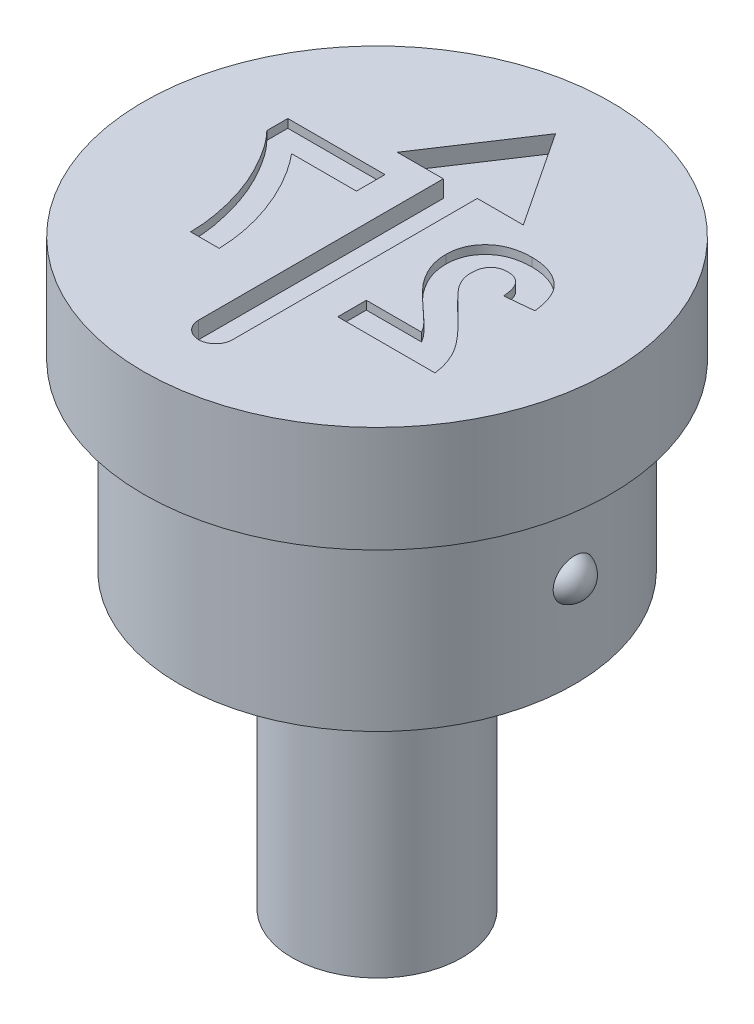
ISO-10303-21;
HEADER;
FILE_DESCRIPTION(('STEP AP214'),'2;1');
FILE_NAME('part.step','',(''),(''),'','','');
FILE_SCHEMA(('AUTOMOTIVE_DESIGN { 1 0 10303 214 1 1 1 1 }'));
ENDSEC;
DATA;
#1=APPLICATION_CONTEXT('core data for automotive mechanical design processes');
#2=APPLICATION_PROTOCOL_DEFINITION('international standard','automotive_design',2000,#1);
#3=PRODUCT_CONTEXT('',#1,'mechanical');
#4=PRODUCT('Part','Part','',(#3));
#5=PRODUCT_RELATED_PRODUCT_CATEGORY('part','',(#4));
#6=PRODUCT_DEFINITION_FORMATION('','',#4);
#7=PRODUCT_DEFINITION_CONTEXT('part definition',#1,'design');
#8=PRODUCT_DEFINITION('design','',#6,#7);
#9=PRODUCT_DEFINITION_SHAPE('','',#8);
#10=(LENGTH_UNIT() NAMED_UNIT(*) SI_UNIT(.MILLI.,.METRE.));
#11=(NAMED_UNIT(*) PLANE_ANGLE_UNIT() SI_UNIT($,.RADIAN.));
#12=(NAMED_UNIT(*) SI_UNIT($,.STERADIAN.) SOLID_ANGLE_UNIT());
#13=UNCERTAINTY_MEASURE_WITH_UNIT(LENGTH_MEASURE(1.E-05),#10,'distance_accuracy_value','');
#14=(GEOMETRIC_REPRESENTATION_CONTEXT(3) GLOBAL_UNCERTAINTY_ASSIGNED_CONTEXT((#13)) GLOBAL_UNIT_ASSIGNED_CONTEXT((#10,
#11,#12)) REPRESENTATION_CONTEXT('',''));
#15=CARTESIAN_POINT('',(0.,0.,0.));
#16=DIRECTION('',(0.,0.,1.));
#17=DIRECTION('',(1.,0.,0.));
#18=AXIS2_PLACEMENT_3D('',#15,#16,#17);
#19=CARTESIAN_POINT('',(0.,0.,0.));
#20=DIRECTION('',(0.,1.,0.));
#21=DIRECTION('',(0.,0.,1.));
#22=AXIS2_PLACEMENT_3D('',#19,#20,#21);
#23=CYLINDRICAL_SURFACE('',#22,4.65);
#24=CARTESIAN_POINT('',(0.,-2.5,0.));
#25=DIRECTION('',(0.,1.,0.));
#26=DIRECTION('',(0.,0.,1.));
#27=AXIS2_PLACEMENT_3D('',#24,#25,#26);
#28=CIRCLE('',#27,4.65);
#29=CARTESIAN_POINT('',(0.,-2.5,4.65));
#30=VERTEX_POINT('',#29);
#31=EDGE_CURVE('E416',#30,#30,#28,.T.);
#32=ORIENTED_EDGE('',*,*,#31,.F.);
#33=EDGE_LOOP('',(#32));
#34=FACE_BOUND('',#33,.T.);
#35=CARTESIAN_POINT('',(0.,-6.8,0.));
#36=DIRECTION('',(0.,1.,0.));
#37=DIRECTION('',(0.,0.,1.));
#38=AXIS2_PLACEMENT_3D('',#35,#36,#37);
#39=CIRCLE('',#38,4.65);
#40=CARTESIAN_POINT('',(0.,-6.8,4.65));
#41=VERTEX_POINT('',#40);
#42=EDGE_CURVE('E413',#41,#41,#39,.T.);
#43=ORIENTED_EDGE('',*,*,#42,.T.);
#44=EDGE_LOOP('',(#43));
#45=FACE_BOUND('',#44,.T.);
#46=CARTESIAN_POINT('',(4.62521812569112,-4.65,-0.479434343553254));
#47=CARTESIAN_POINT('',(4.6252184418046,-4.67612326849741,-0.479433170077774));
#48=CARTESIAN_POINT('',(4.62544891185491,-4.70226394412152,-0.477223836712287));
#49=CARTESIAN_POINT('',(4.6263457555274,-4.75381522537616,-0.468448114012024));
#50=CARTESIAN_POINT('',(4.62701260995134,-4.77922499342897,-0.461876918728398));
#51=CARTESIAN_POINT('',(4.62870594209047,-4.82855481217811,-0.444585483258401));
#52=CARTESIAN_POINT('',(4.62973211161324,-4.8524761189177,-0.433868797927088));
#53=CARTESIAN_POINT('',(4.63202929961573,-4.89818566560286,-0.408612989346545));
#54=CARTESIAN_POINT('',(4.63330027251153,-4.91997430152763,-0.394074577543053));
#55=CARTESIAN_POINT('',(4.63595811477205,-4.96100818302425,-0.361470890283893));
#56=CARTESIAN_POINT('',(4.63734583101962,-4.98023165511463,-0.343378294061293));
#57=CARTESIAN_POINT('',(4.64007620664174,-5.01542685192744,-0.30426384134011));
#58=CARTESIAN_POINT('',(4.64141886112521,-5.03139822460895,-0.283241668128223));
#59=CARTESIAN_POINT('',(4.64393524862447,-5.05992222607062,-0.238485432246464));
#60=CARTESIAN_POINT('',(4.64510577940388,-5.07241318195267,-0.214711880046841));
#61=CARTESIAN_POINT('',(4.64712228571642,-5.09330028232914,-0.165416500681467));
#62=CARTESIAN_POINT('',(4.64796823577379,-5.10169610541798,-0.13989453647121));
#63=CARTESIAN_POINT('',(4.64925251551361,-5.11427033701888,-0.0874519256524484));
#64=CARTESIAN_POINT('',(4.64968511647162,-5.11838954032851,-0.0605169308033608));
#65=CARTESIAN_POINT('',(4.65007461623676,-5.12210314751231,-0.0063330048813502));
#66=CARTESIAN_POINT('',(4.65003149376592,-5.12169734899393,0.0209159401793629));
#67=CARTESIAN_POINT('',(4.64947249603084,-5.11635393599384,0.0751339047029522));
#68=CARTESIAN_POINT('',(4.64895366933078,-5.11138802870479,0.102100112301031));
#69=CARTESIAN_POINT('',(4.64749713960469,-5.0970100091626,0.154809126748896));
#70=CARTESIAN_POINT('',(4.64655943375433,-5.08759786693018,0.180551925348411));
#71=CARTESIAN_POINT('',(4.64437347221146,-5.06459547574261,0.230015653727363));
#72=CARTESIAN_POINT('',(4.64312590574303,-5.05101448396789,0.253740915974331));
#73=CARTESIAN_POINT('',(4.64046130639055,-5.02002500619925,0.298534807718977));
#74=CARTESIAN_POINT('',(4.63904428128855,-5.00261669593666,0.319603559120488));
#75=CARTESIAN_POINT('',(4.63621988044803,-4.96464881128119,0.358242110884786));
#76=CARTESIAN_POINT('',(4.63481256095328,-4.94412447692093,0.375846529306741));
#77=CARTESIAN_POINT('',(4.6321553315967,-4.90036130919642,0.407292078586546));
#78=CARTESIAN_POINT('',(4.63090540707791,-4.87712272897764,0.421133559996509));
#79=CARTESIAN_POINT('',(4.62872796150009,-4.82899753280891,0.444424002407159));
#80=CARTESIAN_POINT('',(4.62779548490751,-4.80414423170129,0.453941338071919));
#81=CARTESIAN_POINT('',(4.62633286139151,-4.7531706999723,0.468614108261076));
#82=CARTESIAN_POINT('',(4.6258026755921,-4.72705059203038,0.473769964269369));
#83=CARTESIAN_POINT('',(4.62521094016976,-4.67470465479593,0.479512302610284));
#84=CARTESIAN_POINT('',(4.62514249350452,-4.64848626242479,0.480166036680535));
#85=CARTESIAN_POINT('',(4.62546365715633,-4.59631561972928,0.477062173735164));
#86=CARTESIAN_POINT('',(4.62585324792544,-4.57036335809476,0.473304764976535));
#87=CARTESIAN_POINT('',(4.62704323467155,-4.51958959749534,0.461524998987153));
#88=CARTESIAN_POINT('',(4.62784163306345,-4.49476323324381,0.453523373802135));
#89=CARTESIAN_POINT('',(4.62975895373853,-4.44679672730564,0.433511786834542));
#90=CARTESIAN_POINT('',(4.63087788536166,-4.42365663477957,0.421501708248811));
#91=CARTESIAN_POINT('',(4.63332312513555,-4.37950753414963,0.393715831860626));
#92=CARTESIAN_POINT('',(4.63465105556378,-4.35851751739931,0.377910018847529));
#93=CARTESIAN_POINT('',(4.63736164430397,-4.31944215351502,0.343048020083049));
#94=CARTESIAN_POINT('',(4.63874430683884,-4.30135703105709,0.323991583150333));
#95=CARTESIAN_POINT('',(4.64143648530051,-4.26829094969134,0.282839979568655));
#96=CARTESIAN_POINT('',(4.64274447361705,-4.25336439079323,0.260701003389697));
#97=CARTESIAN_POINT('',(4.64511960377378,-4.22736785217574,0.214252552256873));
#98=CARTESIAN_POINT('',(4.64618672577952,-4.21629819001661,0.18994289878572));
#99=CARTESIAN_POINT('',(4.64797847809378,-4.198151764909,0.13944029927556));
#100=CARTESIAN_POINT('',(4.64869758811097,-4.19113903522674,0.113224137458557));
#101=CARTESIAN_POINT('',(4.64968930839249,-4.18154915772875,0.0599841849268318));
#102=CARTESIAN_POINT('',(4.64996189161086,-4.17897227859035,0.0329603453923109));
#103=CARTESIAN_POINT('',(4.65003090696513,-4.17831561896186,-0.0213844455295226));
#104=CARTESIAN_POINT('',(4.64982307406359,-4.18027612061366,-0.0487058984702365));
#105=CARTESIAN_POINT('',(4.64894549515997,-4.1887288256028,-0.102631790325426));
#106=CARTESIAN_POINT('',(4.64827573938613,-4.19522112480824,-0.129236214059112));
#107=CARTESIAN_POINT('',(4.64654877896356,-4.21257797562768,-0.180984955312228));
#108=CARTESIAN_POINT('',(4.64549133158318,-4.22344526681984,-0.206128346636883));
#109=CARTESIAN_POINT('',(4.64310883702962,-4.24926995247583,-0.2542051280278));
#110=CARTESIAN_POINT('',(4.6417838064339,-4.26422709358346,-0.277138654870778));
#111=CARTESIAN_POINT('',(4.6390294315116,-4.29769718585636,-0.319942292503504));
#112=CARTESIAN_POINT('',(4.63760100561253,-4.31618076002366,-0.339835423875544));
#113=CARTESIAN_POINT('',(4.63479473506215,-4.35628174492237,-0.376179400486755));
#114=CARTESIAN_POINT('',(4.63341689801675,-4.37789962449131,-0.392629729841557));
#115=CARTESIAN_POINT('',(4.6308922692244,-4.42331634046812,-0.42135778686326));
#116=CARTESIAN_POINT('',(4.62974239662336,-4.44707870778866,-0.43369295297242));
#117=CARTESIAN_POINT('',(4.62778354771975,-4.49635336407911,-0.454120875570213));
#118=CARTESIAN_POINT('',(4.62697415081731,-4.52186344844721,-0.462218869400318));
#119=CARTESIAN_POINT('',(4.62599985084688,-4.56460971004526,-0.471846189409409));
#120=CARTESIAN_POINT('',(4.62570809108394,-4.58155884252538,-0.474687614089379));
#121=CARTESIAN_POINT('',(4.62531712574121,-4.61566947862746,-0.478482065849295));
#122=CARTESIAN_POINT('',(4.62521791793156,-4.63283097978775,-0.479435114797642));
#123=CARTESIAN_POINT('',(4.62521812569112,-4.65,-0.479434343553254));
#124=B_SPLINE_CURVE_WITH_KNOTS('',3,(#46,#47,#48,#49,#50,#51,#52,#53,#54,#55,#56,#57,#58,#59,
#60,#61,#62,#63,#64,#65,#66,#67,#68,#69,#70,#71,#72,#73,#74,#75,#76,#77,#78,#79,#80,#81,#82,#83,
#84,#85,#86,#87,#88,#89,#90,#91,#92,#93,#94,#95,#96,#97,#98,#99,#100,#101,#102,#103,#104,#105,
#106,#107,#108,#109,#110,#111,#112,#113,#114,#115,#116,#117,#118,#119,#120,#121,#122,#123),
.UNSPECIFIED.,.T.,.F.,(4,2,2,2,2,2,2,2,2,2,2,2,2,2,2,2,2,2,2,2,2,2,2,2,2,2,2,2,2,2,2,2,2,2,2,2,
2,2,4),(0.,0.0783066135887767,0.156699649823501,0.235025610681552,0.313337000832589,
0.392275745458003,0.471223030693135,0.551491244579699,0.631765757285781,0.713137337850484,
0.794512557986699,0.87639610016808,0.958280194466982,1.03998375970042,1.12168357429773,
1.20252014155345,1.28334917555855,1.36285137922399,1.44234589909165,1.52065032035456,
1.59895139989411,1.67687347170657,1.75479781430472,1.8333599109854,1.91192808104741,
1.99175555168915,2.07158959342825,2.15265155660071,2.23371842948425,2.31550775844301,
2.39729881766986,2.47914117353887,2.56097846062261,2.64216162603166,2.72335694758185,
2.80336626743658,2.8832764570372,2.93474258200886,2.98620811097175),.UNSPECIFIED.);
#125=CARTESIAN_POINT('',(4.62521812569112,-4.65,-0.479434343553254));
#126=VERTEX_POINT('',#125);
#127=EDGE_CURVE('E41',#126,#126,#124,.T.);
#128=ORIENTED_EDGE('',*,*,#127,.T.);
#129=EDGE_LOOP('',(#128));
#130=FACE_BOUND('',#129,.T.);
#131=ADVANCED_FACE('F37',(#34,#45,#130),#23,.T.);
#132=CARTESIAN_POINT('',(0.,0.,0.));
#133=DIRECTION('',(0.,1.,0.));
#134=DIRECTION('',(0.,0.,1.));
#135=AXIS2_PLACEMENT_3D('',#132,#133,#134);
#136=PLANE('',#135);
#137=DIRECTION('',(-1.,0.,0.));
#138=VECTOR('',#137,1.);
#139=CARTESIAN_POINT('',(2.47066262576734,0.,1.42259458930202));
#140=LINE('',#139,#138);
#141=CARTESIAN_POINT('',(2.47066262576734,0.,1.42259458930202));
#142=VERTEX_POINT('',#141);
#143=CARTESIAN_POINT('',(1.17008169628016,0.,1.42259458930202));
#144=VERTEX_POINT('',#143);
#145=EDGE_CURVE('E58',#142,#144,#140,.T.);
#146=ORIENTED_EDGE('',*,*,#145,.F.);
#147=CARTESIAN_POINT('',(1.50942464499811,0.,0.425599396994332));
#148=CARTESIAN_POINT('',(1.52007022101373,0.,0.439007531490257));
#149=CARTESIAN_POINT('',(1.54287057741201,0.,0.467724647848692));
#150=CARTESIAN_POINT('',(1.58165997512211,0.,0.511757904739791));
#151=CARTESIAN_POINT('',(1.62661355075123,0.,0.559856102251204));
#152=CARTESIAN_POINT('',(1.67709635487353,0.,0.612919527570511));
#153=CARTESIAN_POINT('',(1.73477593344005,0.,0.669069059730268));
#154=CARTESIAN_POINT('',(1.79757697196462,0.,0.730652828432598));
#155=CARTESIAN_POINT('',(1.86826289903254,0.,0.794520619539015));
#156=CARTESIAN_POINT('',(1.94147639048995,0.,0.862265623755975));
#157=CARTESIAN_POINT('',(2.01500811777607,0.,0.928200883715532));
#158=CARTESIAN_POINT('',(2.08259437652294,0.,0.990824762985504));
#159=CARTESIAN_POINT('',(2.1439851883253,0.,1.04623344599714));
#160=CARTESIAN_POINT('',(2.19632146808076,0.,1.09748574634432));
#161=CARTESIAN_POINT('',(2.24268162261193,0.,1.14108373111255));
#162=CARTESIAN_POINT('',(2.28139467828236,0.,1.17926305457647));
#163=CARTESIAN_POINT('',(2.31318504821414,0.,1.2110994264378));
#164=CARTESIAN_POINT('',(2.35699013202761,0.,1.26072425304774));
#165=CARTESIAN_POINT('',(2.41272712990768,0.,1.32784185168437));
#166=CARTESIAN_POINT('',(2.45194038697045,0.,1.39197461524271));
#167=CARTESIAN_POINT('',(2.47066262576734,0.,1.42259458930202));
#168=B_SPLINE_CURVE_WITH_KNOTS('',3,(#147,#148,#149,#150,#151,#152,#153,#154,#155,#156,#157,
#158,#159,#160,#161,#162,#163,#164,#165,#166,#167),.UNSPECIFIED.,.F.,.F.,(4,1,1,1,1,1,1,1,1,1,1,
1,1,1,1,1,1,1,4),(0.,0.0369753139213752,0.0791925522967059,0.126700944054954,0.179184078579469,
0.23736864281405,0.300558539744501,0.369153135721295,0.443112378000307,0.516018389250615,
0.582473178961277,0.642136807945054,0.694619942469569,0.740679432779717,0.779589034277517,
0.812073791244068,0.837814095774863,0.922564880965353,1.),.UNSPECIFIED.);
#169=CARTESIAN_POINT('',(1.50942464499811,0.,0.425599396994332));
#170=VERTEX_POINT('',#169);
#171=EDGE_CURVE('E243',#170,#142,#168,.T.);
#172=ORIENTED_EDGE('',*,*,#171,.F.);
#173=CARTESIAN_POINT('',(1.17008169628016,0.,-0.452205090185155));
#174=CARTESIAN_POINT('',(1.17093800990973,0.,-0.414053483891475));
#175=CARTESIAN_POINT('',(1.17263680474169,0.,-0.338366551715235));
#176=CARTESIAN_POINT('',(1.18890150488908,0.,-0.226478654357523));
#177=CARTESIAN_POINT('',(1.2137508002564,0.,-0.117170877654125));
#178=CARTESIAN_POINT('',(1.25047610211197,0.,-0.010176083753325));
#179=CARTESIAN_POINT('',(1.29702827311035,0.,0.0970722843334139));
#180=CARTESIAN_POINT('',(1.35703513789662,0.,0.204814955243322));
#181=CARTESIAN_POINT('',(1.42670764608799,0.,0.316301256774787));
#182=CARTESIAN_POINT('',(1.48125847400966,0.,0.38838201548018));
#183=CARTESIAN_POINT('',(1.50942464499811,0.,0.425599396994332));
#184=B_SPLINE_CURVE_WITH_KNOTS('',3,(#173,#174,#175,#176,#177,#178,#179,#180,#181,#182,#183),
.UNSPECIFIED.,.F.,.F.,(4,1,1,1,1,1,1,1,4),(0.,0.119176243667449,0.236427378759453,
0.352663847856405,0.469086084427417,0.58946290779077,0.717601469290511,0.854189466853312,1.),.UNSPECIFIED.);
#185=CARTESIAN_POINT('',(1.17008169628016,0.,-0.452205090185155));
#186=VERTEX_POINT('',#185);
#187=EDGE_CURVE('E246',#186,#170,#184,.T.);
#188=ORIENTED_EDGE('',*,*,#187,.F.);
#189=CARTESIAN_POINT('',(2.24420028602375,0.,-1.40432848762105));
#190=CARTESIAN_POINT('',(2.2035051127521,0.,-1.4035463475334));
#191=CARTESIAN_POINT('',(2.12424615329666,0.,-1.40202303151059));
#192=CARTESIAN_POINT('',(2.00854214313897,0.,-1.38944347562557));
#193=CARTESIAN_POINT('',(1.89984653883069,0.,-1.36750919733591));
#194=CARTESIAN_POINT('',(1.7972090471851,0.,-1.33845414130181));
#195=CARTESIAN_POINT('',(1.70168370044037,0.,-1.29966351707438));
#196=CARTESIAN_POINT('',(1.61247448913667,0.,-1.25276726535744));
#197=CARTESIAN_POINT('',(1.53098541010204,0.,-1.19598557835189));
#198=CARTESIAN_POINT('',(1.45600175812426,0.,-1.13241500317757));
#199=CARTESIAN_POINT('',(1.38897237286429,0.,-1.0625079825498));
#200=CARTESIAN_POINT('',(1.33026069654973,0.,-0.987940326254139));
#201=CARTESIAN_POINT('',(1.28107224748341,0.,-0.908763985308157));
#202=CARTESIAN_POINT('',(1.23979558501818,0.,-0.825944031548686));
#203=CARTESIAN_POINT('',(1.20914794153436,0.,-0.738147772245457));
#204=CARTESIAN_POINT('',(1.18681673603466,0.,-0.64658918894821));
#205=CARTESIAN_POINT('',(1.17201024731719,0.,-0.550841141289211));
#206=CARTESIAN_POINT('',(1.17073165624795,0.,-0.485447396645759));
#207=CARTESIAN_POINT('',(1.17008169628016,0.,-0.452205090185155));
#208=B_SPLINE_CURVE_WITH_KNOTS('',3,(#189,#190,#191,#192,#193,#194,#195,#196,#197,#198,#199,
#200,#201,#202,#203,#204,#205,#206,#207),.UNSPECIFIED.,.F.,.F.,(4,1,1,1,1,1,1,1,1,1,1,1,1,1,1,1,
4),(0.,0.0756723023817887,0.147381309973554,0.216084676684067,0.28169803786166,
0.345459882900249,0.407485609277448,0.46873129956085,0.529782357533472,0.590032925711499,
0.648548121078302,0.70595351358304,0.763101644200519,0.820289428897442,0.878479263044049,
0.938226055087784,1.),.UNSPECIFIED.);
#209=CARTESIAN_POINT('',(2.24420028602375,0.,-1.40432848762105));
#210=VERTEX_POINT('',#209);
#211=EDGE_CURVE('E552',#210,#186,#208,.T.);
#212=ORIENTED_EDGE('',*,*,#211,.F.);
#213=CARTESIAN_POINT('',(3.36879964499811,0.,-0.348439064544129));
#214=CARTESIAN_POINT('',(3.36338821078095,0.,-0.393880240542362));
#215=CARTESIAN_POINT('',(3.35289630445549,0.,-0.481983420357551));
#216=CARTESIAN_POINT('',(3.32671357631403,0.,-0.608529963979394));
#217=CARTESIAN_POINT('',(3.29355412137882,0.,-0.725274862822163));
#218=CARTESIAN_POINT('',(3.251837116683,0.,-0.832001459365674));
#219=CARTESIAN_POINT('',(3.2032867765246,0.,-0.929388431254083));
#220=CARTESIAN_POINT('',(3.14542662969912,0.,-1.01597442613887));
#221=CARTESIAN_POINT('',(3.0802783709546,0.,-1.09271857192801));
#222=CARTESIAN_POINT('',(3.00778569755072,0.,-1.15958002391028));
#223=CARTESIAN_POINT('',(2.92840946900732,0.,-1.21677148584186));
#224=CARTESIAN_POINT('',(2.84511835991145,0.,-1.26782364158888));
#225=CARTESIAN_POINT('',(2.75628462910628,0.,-1.30970263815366));
#226=CARTESIAN_POINT('',(2.66288633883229,0.,-1.34421722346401));
#227=CARTESIAN_POINT('',(2.5649656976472,0.,-1.37180100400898));
#228=CARTESIAN_POINT('',(2.46206980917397,0.,-1.39003902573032));
#229=CARTESIAN_POINT('',(2.35483370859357,0.,-1.4028677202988));
#230=CARTESIAN_POINT('',(2.28163389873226,0.,-1.40383422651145));
#231=CARTESIAN_POINT('',(2.24420028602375,0.,-1.40432848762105));
#232=B_SPLINE_CURVE_WITH_KNOTS('',3,(#213,#214,#215,#216,#217,#218,#219,#220,#221,#222,#223,
#224,#225,#226,#227,#228,#229,#230,#231),.UNSPECIFIED.,.F.,.F.,(4,1,1,1,1,1,1,1,1,1,1,1,1,1,1,1,
4),(0.,0.0794357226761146,0.154013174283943,0.224141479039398,0.289934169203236,
0.352732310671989,0.412725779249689,0.470302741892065,0.527168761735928,0.583502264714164,
0.639948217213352,0.696584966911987,0.753726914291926,0.812707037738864,0.872963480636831,
0.93503486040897,1.),.UNSPECIFIED.);
#233=CARTESIAN_POINT('',(3.36879964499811,0.,-0.348439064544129));
#234=VERTEX_POINT('',#233);
#235=EDGE_CURVE('E560',#234,#210,#232,.T.);
#236=ORIENTED_EDGE('',*,*,#235,.F.);
#237=DIRECTION('',(0.995240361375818,0.,-0.0974506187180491));
#238=VECTOR('',#237,1.);
#239=CARTESIAN_POINT('',(2.69572272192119,0.,-0.282533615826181));
#240=LINE('',#239,#238);
#241=CARTESIAN_POINT('',(2.69572272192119,0.,-0.282533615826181));
#242=VERTEX_POINT('',#241);
#243=EDGE_CURVE('E568',#242,#234,#240,.T.);
#244=ORIENTED_EDGE('',*,*,#243,.F.);
#245=CARTESIAN_POINT('',(2.25822272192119,0.,-0.820995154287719));
#246=CARTESIAN_POINT('',(2.28875055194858,0.,-0.819612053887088));
#247=CARTESIAN_POINT('',(2.34772372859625,0.,-0.81694020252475));
#248=CARTESIAN_POINT('',(2.4315374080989,0.,-0.7935992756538));
#249=CARTESIAN_POINT('',(2.50485890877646,0.,-0.753193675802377));
#250=CARTESIAN_POINT('',(2.55711170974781,0.,-0.707147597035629));
#251=CARTESIAN_POINT('',(2.59241095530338,0.,-0.66237112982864));
#252=CARTESIAN_POINT('',(2.61646262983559,0.,-0.623351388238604));
#253=CARTESIAN_POINT('',(2.63719329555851,0.,-0.579012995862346));
#254=CARTESIAN_POINT('',(2.65556239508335,0.,-0.52985512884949));
#255=CARTESIAN_POINT('',(2.6700719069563,0.,-0.475314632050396));
#256=CARTESIAN_POINT('',(2.68175696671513,0.,-0.41580688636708));
#257=CARTESIAN_POINT('',(2.69117343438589,0.,-0.351011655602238));
#258=CARTESIAN_POINT('',(2.69416803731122,0.,-0.305935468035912));
#259=CARTESIAN_POINT('',(2.69572272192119,0.,-0.282533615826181));
#260=B_SPLINE_CURVE_WITH_KNOTS('',3,(#245,#246,#247,#248,#249,#250,#251,#252,#253,#254,#255,
#256,#257,#258,#259),.UNSPECIFIED.,.F.,.F.,(4,1,1,1,1,1,1,1,1,1,1,1,4),(0.,0.116899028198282,
0.225823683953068,0.330086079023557,0.435451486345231,0.490306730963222,0.548244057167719,
0.610766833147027,0.677675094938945,0.749188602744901,0.826858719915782,0.910111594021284,1.),.UNSPECIFIED.);
#261=CARTESIAN_POINT('',(2.25822272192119,0.,-0.820995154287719));
#262=VERTEX_POINT('',#261);
#263=EDGE_CURVE('E574',#262,#242,#260,.T.);
#264=ORIENTED_EDGE('',*,*,#263,.F.);
#265=CARTESIAN_POINT('',(1.84315861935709,0.,-0.361760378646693));
#266=CARTESIAN_POINT('',(1.84441920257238,0.,-0.396681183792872));
#267=CARTESIAN_POINT('',(1.84680412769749,0.,-0.462748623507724));
#268=CARTESIAN_POINT('',(1.86680213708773,0.,-0.55598199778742));
#269=CARTESIAN_POINT('',(1.90226536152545,0.,-0.636129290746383));
#270=CARTESIAN_POINT('',(1.95109169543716,0.,-0.703436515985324));
#271=CARTESIAN_POINT('',(2.01283269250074,0.,-0.756171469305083));
#272=CARTESIAN_POINT('',(2.08500971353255,0.,-0.795137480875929));
#273=CARTESIAN_POINT('',(2.16867931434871,0.,-0.816680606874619));
#274=CARTESIAN_POINT('',(2.22748724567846,0.,-0.819514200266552));
#275=CARTESIAN_POINT('',(2.25822272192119,0.,-0.820995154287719));
#276=B_SPLINE_CURVE_WITH_KNOTS('',3,(#265,#266,#267,#268,#269,#270,#271,#272,#273,#274,#275),
.UNSPECIFIED.,.F.,.F.,(4,1,1,1,1,1,1,1,4),(0.,0.149140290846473,0.282161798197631,
0.404655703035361,0.521109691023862,0.634416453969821,0.748796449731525,0.868710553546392,1.),.UNSPECIFIED.);
#277=CARTESIAN_POINT('',(1.84315861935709,0.,-0.361760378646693));
#278=VERTEX_POINT('',#277);
#279=EDGE_CURVE('E579',#278,#262,#276,.T.);
#280=ORIENTED_EDGE('',*,*,#279,.F.);
#281=CARTESIAN_POINT('',(1.97637176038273,0.,0.0427868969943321));
#282=CARTESIAN_POINT('',(1.95610693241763,0.,0.00912485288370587));
#283=CARTESIAN_POINT('',(1.91701842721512,0.,-0.0558053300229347));
#284=CARTESIAN_POINT('',(1.87415463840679,0.,-0.157909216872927));
#285=CARTESIAN_POINT('',(1.84842619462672,0.,-0.259992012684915));
#286=CARTESIAN_POINT('',(1.84489555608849,0.,-0.328203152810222));
#287=CARTESIAN_POINT('',(1.84315861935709,0.,-0.361760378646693));
#288=B_SPLINE_CURVE_WITH_KNOTS('',3,(#281,#282,#283,#284,#285,#286,#287),.UNSPECIFIED.,.F.,.F.,
(4,1,1,1,4),(0.,0.272795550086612,0.526191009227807,0.766904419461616,1.),.UNSPECIFIED.);
#289=CARTESIAN_POINT('',(1.97637176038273,0.,0.0427868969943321));
#290=VERTEX_POINT('',#289);
#291=EDGE_CURVE('E587',#290,#278,#288,.T.);
#292=ORIENTED_EDGE('',*,*,#291,.F.);
#293=CARTESIAN_POINT('',(2.51202881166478,0.,0.607891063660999));
#294=CARTESIAN_POINT('',(2.47742420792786,0.,0.574488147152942));
#295=CARTESIAN_POINT('',(2.41154723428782,0.,0.510898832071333));
#296=CARTESIAN_POINT('',(2.31773829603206,0.,0.419841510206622));
#297=CARTESIAN_POINT('',(2.23527057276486,0.,0.336133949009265));
#298=CARTESIAN_POINT('',(2.16241977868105,0.,0.261945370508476));
#299=CARTESIAN_POINT('',(2.10086887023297,0.,0.19538674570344));
#300=CARTESIAN_POINT('',(2.04980820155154,0.,0.137503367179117));
#301=CARTESIAN_POINT('',(2.00859109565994,0.,0.0880595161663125));
#302=CARTESIAN_POINT('',(1.98626787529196,0.,0.0566923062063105));
#303=CARTESIAN_POINT('',(1.97637176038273,0.,0.0427868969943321));
#304=B_SPLINE_CURVE_WITH_KNOTS('',3,(#293,#294,#295,#296,#297,#298,#299,#300,#301,#302,#303),
.UNSPECIFIED.,.F.,.F.,(4,1,1,1,1,1,1,1,4),(0.,0.18509006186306,0.352356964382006,
0.503079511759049,0.637279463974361,0.752473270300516,0.851885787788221,0.934339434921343,1.),.UNSPECIFIED.);
#305=CARTESIAN_POINT('',(2.51202881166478,0.,0.607891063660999));
#306=VERTEX_POINT('',#305);
#307=EDGE_CURVE('E595',#306,#290,#304,.T.);
#308=ORIENTED_EDGE('',*,*,#307,.F.);
#309=CARTESIAN_POINT('',(3.4585432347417,0.,2.09567151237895));
#310=CARTESIAN_POINT('',(3.45079503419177,0.,2.03814732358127));
#311=CARTESIAN_POINT('',(3.43530297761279,0.,1.92313120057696));
#312=CARTESIAN_POINT('',(3.38740707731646,0.,1.75512159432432));
#313=CARTESIAN_POINT('',(3.32348245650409,0.,1.59117292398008));
#314=CARTESIAN_POINT('',(3.2541044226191,0.,1.45775850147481));
#315=CARTESIAN_POINT('',(3.18510028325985,0.,1.35036448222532));
#316=CARTESIAN_POINT('',(3.12249282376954,0.,1.26236499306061));
#317=CARTESIAN_POINT('',(3.04780442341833,0.,1.16873731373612));
#318=CARTESIAN_POINT('',(2.9621188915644,0.,1.06872560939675));
#319=CARTESIAN_POINT('',(2.86590976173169,0.,0.962017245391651));
#320=CARTESIAN_POINT('',(2.75845925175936,0.,0.849008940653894));
#321=CARTESIAN_POINT('',(2.63925480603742,0.,0.730241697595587));
#322=CARTESIAN_POINT('',(2.55539235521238,0.,0.649592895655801));
#323=CARTESIAN_POINT('',(2.51202881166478,0.,0.607891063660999));
#324=B_SPLINE_CURVE_WITH_KNOTS('',3,(#309,#310,#311,#312,#313,#314,#315,#316,#317,#318,#319,
#320,#321,#322,#323),.UNSPECIFIED.,.F.,.F.,(4,1,1,1,1,1,1,1,1,1,1,1,4),(0.,0.0963574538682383,
0.192660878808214,0.289454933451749,0.388479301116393,0.441921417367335,0.501521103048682,
0.567882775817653,0.640891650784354,0.72037065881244,0.806636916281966,0.900015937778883,1.),.UNSPECIFIED.);
#325=CARTESIAN_POINT('',(3.4585432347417,0.,2.09567151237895));
#326=VERTEX_POINT('',#325);
#327=EDGE_CURVE('E603',#326,#306,#324,.T.);
#328=ORIENTED_EDGE('',*,*,#327,.F.);
#329=DIRECTION('',(1.,0.,0.));
#330=VECTOR('',#329,1.);
#331=CARTESIAN_POINT('',(1.17008169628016,0.,2.09567151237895));
#332=LINE('',#331,#330);
#333=CARTESIAN_POINT('',(1.17008169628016,0.,2.09567151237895));
#334=VERTEX_POINT('',#333);
#335=EDGE_CURVE('E611',#334,#326,#332,.T.);
#336=ORIENTED_EDGE('',*,*,#335,.F.);
#337=DIRECTION('',(0.,0.,1.));
#338=VECTOR('',#337,1.);
#339=CARTESIAN_POINT('',(1.17008169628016,0.,1.42259458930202));
#340=LINE('',#339,#338);
#341=EDGE_CURVE('E617',#144,#334,#340,.T.);
#342=ORIENTED_EDGE('',*,*,#341,.F.);
#343=EDGE_LOOP('',(#146,#172,#188,#212,#236,#244,#264,#280,#292,#308,#328,#336,#342));
#344=FACE_BOUND('',#343,.T.);
#345=DIRECTION('',(1.,0.,0.));
#346=VECTOR('',#345,1.);
#347=CARTESIAN_POINT('',(-2.69856814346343,0.,-0.686379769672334));
#348=LINE('',#347,#346);
#349=CARTESIAN_POINT('',(-2.69856814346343,0.,-0.686379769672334));
#350=VERTEX_POINT('',#349);
#351=CARTESIAN_POINT('',(-1.17222599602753,0.,-0.686379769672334));
#352=VERTEX_POINT('',#351);
#353=EDGE_CURVE('E66',#350,#352,#348,.T.);
#354=ORIENTED_EDGE('',*,*,#353,.F.);
#355=CARTESIAN_POINT('',(-1.62094394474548,0.,2.09567151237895));
#356=CARTESIAN_POINT('',(-1.62319456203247,0.,2.03604480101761));
#357=CARTESIAN_POINT('',(-1.62772079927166,0.,1.91612897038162));
#358=CARTESIAN_POINT('',(-1.64465549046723,0.,1.73613922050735));
#359=CARTESIAN_POINT('',(-1.67125324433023,0.,1.55547926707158));
#360=CARTESIAN_POINT('',(-1.70428943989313,0.,1.37373157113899));
#361=CARTESIAN_POINT('',(-1.74790545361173,0.,1.19133859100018));
#362=CARTESIAN_POINT('',(-1.79768468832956,0.,1.0076246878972));
#363=CARTESIAN_POINT('',(-1.85798474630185,0.,0.823571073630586));
#364=CARTESIAN_POINT('',(-1.92557949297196,0.,0.639529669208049));
#365=CARTESIAN_POINT('',(-2.00020054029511,0.,0.457247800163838));
#366=CARTESIAN_POINT('',(-2.08152698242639,0.,0.278986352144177));
#367=CARTESIAN_POINT('',(-2.16934858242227,0.,0.105857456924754));
#368=CARTESIAN_POINT('',(-2.26252323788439,0.,-0.0627471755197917));
#369=CARTESIAN_POINT('',(-2.36213490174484,0.,-0.226285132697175));
#370=CARTESIAN_POINT('',(-2.46825857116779,0.,-0.384578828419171));
#371=CARTESIAN_POINT('',(-2.57938890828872,0.,-0.538773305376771));
#372=CARTESIAN_POINT('',(-2.65884842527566,0.,-0.637185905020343));
#373=CARTESIAN_POINT('',(-2.69856814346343,0.,-0.686379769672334));
#374=B_SPLINE_CURVE_WITH_KNOTS('',3,(#355,#356,#357,#358,#359,#360,#361,#362,#363,#364,#365,
#366,#367,#368,#369,#370,#371,#372,#373),.UNSPECIFIED.,.F.,.F.,(4,1,1,1,1,1,1,1,1,1,1,1,1,1,1,1,
4),(0.,0.0589531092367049,0.118561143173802,0.178522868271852,0.239353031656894,
0.301026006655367,0.363773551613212,0.427382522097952,0.492333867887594,0.557475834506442,
0.621960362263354,0.685889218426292,0.749254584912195,0.812267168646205,0.875035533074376,
0.937533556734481,1.),.UNSPECIFIED.);
#375=CARTESIAN_POINT('',(-1.62094394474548,0.,2.09567151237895));
#376=VERTEX_POINT('',#375);
#377=EDGE_CURVE('E328',#376,#350,#374,.T.);
#378=ORIENTED_EDGE('',*,*,#377,.F.);
#379=DIRECTION('',(1.,0.,0.));
#380=VECTOR('',#379,1.);
#381=CARTESIAN_POINT('',(-2.2940208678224,0.,2.09567151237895));
#382=LINE('',#381,#380);
#383=CARTESIAN_POINT('',(-2.2940208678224,0.,2.09567151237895));
#384=VERTEX_POINT('',#383);
#385=EDGE_CURVE('E322',#384,#376,#382,.T.);
#386=ORIENTED_EDGE('',*,*,#385,.F.);
#387=CARTESIAN_POINT('',(-3.46068753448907,0.,-0.865866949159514));
#388=CARTESIAN_POINT('',(-3.43681456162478,0.,-0.841576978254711));
#389=CARTESIAN_POINT('',(-3.38773858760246,0.,-0.791643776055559));
#390=CARTESIAN_POINT('',(-3.31744205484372,0.,-0.709923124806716));
#391=CARTESIAN_POINT('',(-3.24610398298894,0.,-0.621241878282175));
#392=CARTESIAN_POINT('',(-3.1752161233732,0.,-0.524405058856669));
#393=CARTESIAN_POINT('',(-3.10257496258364,0.,-0.420942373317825));
#394=CARTESIAN_POINT('',(-3.0313728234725,0.,-0.308870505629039));
#395=CARTESIAN_POINT('',(-2.95915792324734,0.,-0.189643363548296));
#396=CARTESIAN_POINT('',(-2.86193383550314,0.,-0.0209963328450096));
#397=CARTESIAN_POINT('',(-2.74829100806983,0.,0.199308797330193));
#398=CARTESIAN_POINT('',(-2.62806290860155,0.,0.473159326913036));
#399=CARTESIAN_POINT('',(-2.52563407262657,0.,0.755420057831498));
#400=CARTESIAN_POINT('',(-2.45549530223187,0.,0.995927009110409));
#401=CARTESIAN_POINT('',(-2.40810527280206,0.,1.18869296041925));
#402=CARTESIAN_POINT('',(-2.37714292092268,0.,1.32964799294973));
#403=CARTESIAN_POINT('',(-2.35107919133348,0.,1.4666363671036));
#404=CARTESIAN_POINT('',(-2.32987636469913,0.,1.59989883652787));
#405=CARTESIAN_POINT('',(-2.31405209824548,0.,1.72949619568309));
#406=CARTESIAN_POINT('',(-2.30154822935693,0.,1.85497787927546));
#407=CARTESIAN_POINT('',(-2.2953793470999,0.,1.97664987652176));
#408=CARTESIAN_POINT('',(-2.29446906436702,0.,2.05640327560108));
#409=CARTESIAN_POINT('',(-2.2940208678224,0.,2.09567151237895));
#410=B_SPLINE_CURVE_WITH_KNOTS('',3,(#387,#388,#389,#390,#391,#392,#393,#394,#395,#396,#397,
#398,#399,#400,#401,#402,#403,#404,#405,#406,#407,#408,#409),.UNSPECIFIED.,.F.,.F.,(4,1,1,1,1,1,
1,1,1,1,1,1,1,1,1,1,1,1,1,1,4),(0.,0.0314272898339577,0.0646054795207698,0.0994393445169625,
0.136456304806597,0.175351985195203,0.216100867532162,0.258977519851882,0.304007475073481,
0.395756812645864,0.487615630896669,0.579873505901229,0.672707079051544,0.718694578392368,
0.76307923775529,0.80589344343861,0.847386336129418,0.88760014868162,0.926386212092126,
0.963754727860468,1.),.UNSPECIFIED.);
#411=CARTESIAN_POINT('',(-3.46068753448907,0.,-0.865866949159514));
#412=VERTEX_POINT('',#411);
#413=EDGE_CURVE('E317',#412,#384,#410,.T.);
#414=ORIENTED_EDGE('',*,*,#413,.F.);
#415=DIRECTION('',(0.,0.,1.));
#416=VECTOR('',#415,1.);
#417=CARTESIAN_POINT('',(-3.46068753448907,0.,-1.35945669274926));
#418=LINE('',#417,#416);
#419=CARTESIAN_POINT('',(-3.46068753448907,0.,-1.35945669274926));
#420=VERTEX_POINT('',#419);
#421=EDGE_CURVE('E314',#420,#412,#418,.T.);
#422=ORIENTED_EDGE('',*,*,#421,.F.);
#423=DIRECTION('',(-1.,0.,0.));
#424=VECTOR('',#423,1.);
#425=CARTESIAN_POINT('',(-1.17222599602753,0.,-1.35945669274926));
#426=LINE('',#425,#424);
#427=CARTESIAN_POINT('',(-1.17222599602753,0.,-1.35945669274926));
#428=VERTEX_POINT('',#427);
#429=EDGE_CURVE('E311',#428,#420,#426,.T.);
#430=ORIENTED_EDGE('',*,*,#429,.F.);
#431=DIRECTION('',(0.,0.,-1.));
#432=VECTOR('',#431,1.);
#433=CARTESIAN_POINT('',(-1.17222599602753,0.,-0.686379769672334));
#434=LINE('',#433,#432);
#435=EDGE_CURVE('E308',#352,#428,#434,.T.);
#436=ORIENTED_EDGE('',*,*,#435,.F.);
#437=EDGE_LOOP('',(#354,#378,#386,#414,#422,#430,#436));
#438=FACE_BOUND('',#437,.T.);
#439=DIRECTION('',(-0.551936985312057,0.,-0.833885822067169));
#440=VECTOR('',#439,1.);
#441=CARTESIAN_POINT('',(1.48262365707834,0.,-1.96));
#442=LINE('',#441,#440);
#443=CARTESIAN_POINT('',(1.48262365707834,0.,-1.96));
#444=VERTEX_POINT('',#443);
#445=CARTESIAN_POINT('',(0.,0.,-4.2));
#446=VERTEX_POINT('',#445);
#447=EDGE_CURVE('E373',#444,#446,#442,.T.);
#448=ORIENTED_EDGE('',*,*,#447,.F.);
#449=DIRECTION('',(1.,0.,0.));
#450=VECTOR('',#449,1.);
#451=CARTESIAN_POINT('',(0.400000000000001,0.,-1.96));
#452=LINE('',#451,#450);
#453=CARTESIAN_POINT('',(0.400000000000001,0.,-1.96));
#454=VERTEX_POINT('',#453);
#455=EDGE_CURVE('E354',#454,#444,#452,.T.);
#456=ORIENTED_EDGE('',*,*,#455,.F.);
#457=DIRECTION('',(0.,0.,-1.));
#458=VECTOR('',#457,1.);
#459=CARTESIAN_POINT('',(0.400000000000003,0.,3.8));
#460=LINE('',#459,#458);
#461=CARTESIAN_POINT('',(0.400000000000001,0.,3.8));
#462=VERTEX_POINT('',#461);
#463=EDGE_CURVE('E388',#462,#454,#460,.T.);
#464=ORIENTED_EDGE('',*,*,#463,.F.);
#465=CARTESIAN_POINT('',(0.,0.,3.8));
#466=DIRECTION('',(0.,1.,0.));
#467=DIRECTION('',(0.,0.,1.));
#468=AXIS2_PLACEMENT_3D('',#465,#466,#467);
#469=CIRCLE('',#468,0.400000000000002);
#470=CARTESIAN_POINT('',(-0.400000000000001,0.,3.8));
#471=VERTEX_POINT('',#470);
#472=EDGE_CURVE('E385',#471,#462,#469,.T.);
#473=ORIENTED_EDGE('',*,*,#472,.F.);
#474=DIRECTION('',(0.,0.,1.));
#475=VECTOR('',#474,1.);
#476=CARTESIAN_POINT('',(-0.400000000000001,0.,-1.96));
#477=LINE('',#476,#475);
#478=CARTESIAN_POINT('',(-0.400000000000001,0.,-1.96));
#479=VERTEX_POINT('',#478);
#480=EDGE_CURVE('E382',#479,#471,#477,.T.);
#481=ORIENTED_EDGE('',*,*,#480,.F.);
#482=DIRECTION('',(1.,0.,0.));
#483=VECTOR('',#482,1.);
#484=CARTESIAN_POINT('',(-1.48262365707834,0.,-1.96));
#485=LINE('',#484,#483);
#486=CARTESIAN_POINT('',(-1.48262365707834,0.,-1.96));
#487=VERTEX_POINT('',#486);
#488=EDGE_CURVE('E379',#487,#479,#485,.T.);
#489=ORIENTED_EDGE('',*,*,#488,.F.);
#490=DIRECTION('',(-0.551936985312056,0.,0.833885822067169));
#491=VECTOR('',#490,1.);
#492=CARTESIAN_POINT('',(0.,0.,-4.2));
#493=LINE('',#492,#491);
#494=EDGE_CURVE('E375',#446,#487,#493,.T.);
#495=ORIENTED_EDGE('',*,*,#494,.F.);
#496=EDGE_LOOP('',(#448,#456,#464,#473,#481,#489,#495));
#497=FACE_BOUND('',#496,.T.);
#498=CARTESIAN_POINT('',(0.,0.,0.));
#499=DIRECTION('',(0.,1.,0.));
#500=DIRECTION('',(0.,0.,1.));
#501=AXIS2_PLACEMENT_3D('',#498,#499,#500);
#502=CIRCLE('',#501,5.5);
#503=CARTESIAN_POINT('',(0.,0.,5.5));
#504=VERTEX_POINT('',#503);
#505=EDGE_CURVE('E11',#504,#504,#502,.T.);
#506=ORIENTED_EDGE('',*,*,#505,.T.);
#507=EDGE_LOOP('',(#506));
#508=FACE_BOUND('',#507,.T.);
#509=ADVANCED_FACE('F39',(#344,#438,#497,#508),#136,.T.);
#510=CARTESIAN_POINT('',(0.,0.,0.));
#511=DIRECTION('',(0.,1.,0.));
#512=DIRECTION('',(0.,0.,1.));
#513=AXIS2_PLACEMENT_3D('',#510,#511,#512);
#514=CYLINDRICAL_SURFACE('',#513,5.5);
#515=CARTESIAN_POINT('',(0.,-2.5,0.));
#516=DIRECTION('',(0.,1.,0.));
#517=DIRECTION('',(0.,0.,1.));
#518=AXIS2_PLACEMENT_3D('',#515,#516,#517);
#519=CIRCLE('',#518,5.5);
#520=CARTESIAN_POINT('',(0.,-2.5,5.5));
#521=VERTEX_POINT('',#520);
#522=EDGE_CURVE('E51',#521,#521,#519,.T.);
#523=ORIENTED_EDGE('',*,*,#522,.T.);
#524=EDGE_LOOP('',(#523));
#525=FACE_BOUND('',#524,.T.);
#526=ORIENTED_EDGE('',*,*,#505,.F.);
#527=EDGE_LOOP('',(#526));
#528=FACE_BOUND('',#527,.T.);
#529=ADVANCED_FACE('F422',(#525,#528),#514,.T.);
#530=CARTESIAN_POINT('',(-5.5,-2.5,0.));
#531=DIRECTION('',(0.,-1.,0.));
#532=DIRECTION('',(0.,0.,-1.));
#533=AXIS2_PLACEMENT_3D('',#530,#531,#532);
#534=PLANE('',#533);
#535=ORIENTED_EDGE('',*,*,#31,.T.);
#536=EDGE_LOOP('',(#535));
#537=FACE_BOUND('',#536,.T.);
#538=ORIENTED_EDGE('',*,*,#522,.F.);
#539=EDGE_LOOP('',(#538));
#540=FACE_BOUND('',#539,.T.);
#541=ADVANCED_FACE('F425',(#537,#540),#534,.T.);
#542=CARTESIAN_POINT('',(-4.65,-6.8,0.));
#543=DIRECTION('',(0.,-1.,0.));
#544=DIRECTION('',(0.,0.,-1.));
#545=AXIS2_PLACEMENT_3D('',#542,#543,#544);
#546=PLANE('',#545);
#547=CARTESIAN_POINT('',(0.,-6.8,0.));
#548=DIRECTION('',(0.,1.,0.));
#549=DIRECTION('',(0.,0.,1.));
#550=AXIS2_PLACEMENT_3D('',#547,#548,#549);
#551=CIRCLE('',#550,2.);
#552=CARTESIAN_POINT('',(0.,-6.8,2.));
#553=VERTEX_POINT('',#552);
#554=EDGE_CURVE('E410',#553,#553,#551,.T.);
#555=ORIENTED_EDGE('',*,*,#554,.T.);
#556=EDGE_LOOP('',(#555));
#557=FACE_BOUND('',#556,.T.);
#558=ORIENTED_EDGE('',*,*,#42,.F.);
#559=EDGE_LOOP('',(#558));
#560=FACE_BOUND('',#559,.T.);
#561=ADVANCED_FACE('F427',(#557,#560),#546,.T.);
#562=CARTESIAN_POINT('',(0.,0.,0.));
#563=DIRECTION('',(0.,1.,0.));
#564=DIRECTION('',(0.,0.,1.));
#565=AXIS2_PLACEMENT_3D('',#562,#563,#564);
#566=CYLINDRICAL_SURFACE('',#565,2.);
#567=CARTESIAN_POINT('',(0.,-13.7,0.));
#568=DIRECTION('',(0.,1.,0.));
#569=DIRECTION('',(0.,0.,1.));
#570=AXIS2_PLACEMENT_3D('',#567,#568,#569);
#571=CIRCLE('',#570,2.);
#572=CARTESIAN_POINT('',(0.,-13.7,2.));
#573=VERTEX_POINT('',#572);
#574=EDGE_CURVE('E395',#573,#573,#571,.T.);
#575=ORIENTED_EDGE('',*,*,#574,.T.);
#576=EDGE_LOOP('',(#575));
#577=FACE_BOUND('',#576,.T.);
#578=ORIENTED_EDGE('',*,*,#554,.F.);
#579=EDGE_LOOP('',(#578));
#580=FACE_BOUND('',#579,.T.);
#581=ADVANCED_FACE('F434',(#577,#580),#566,.T.);
#582=CARTESIAN_POINT('',(-2.,-13.7,0.));
#583=DIRECTION('',(0.,-1.,0.));
#584=DIRECTION('',(0.,0.,-1.));
#585=AXIS2_PLACEMENT_3D('',#582,#583,#584);
#586=PLANE('',#585);
#587=ORIENTED_EDGE('',*,*,#574,.F.);
#588=EDGE_LOOP('',(#587));
#589=FACE_BOUND('',#588,.T.);
#590=ADVANCED_FACE('F449',(#589),#586,.T.);
#591=CARTESIAN_POINT('',(1.48262365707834,-0.4,-1.96));
#592=DIRECTION('',(0.833885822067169,0.,-0.551936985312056));
#593=DIRECTION('',(-0.551936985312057,0.,-0.833885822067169));
#594=AXIS2_PLACEMENT_3D('',#591,#592,#593);
#595=PLANE('',#594);
#596=ORIENTED_EDGE('',*,*,#447,.T.);
#597=DIRECTION('',(0.,1.,0.));
#598=VECTOR('',#597,1.);
#599=CARTESIAN_POINT('',(0.,-0.4,-4.2));
#600=LINE('',#599,#598);
#601=CARTESIAN_POINT('',(0.,-0.4,-4.2));
#602=VERTEX_POINT('',#601);
#603=EDGE_CURVE('E372',#602,#446,#600,.T.);
#604=ORIENTED_EDGE('',*,*,#603,.F.);
#605=DIRECTION('',(-0.551936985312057,0.,-0.833885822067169));
#606=VECTOR('',#605,1.);
#607=CARTESIAN_POINT('',(1.48262365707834,-0.4,-1.96));
#608=LINE('',#607,#606);
#609=CARTESIAN_POINT('',(1.48262365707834,-0.4,-1.96));
#610=VERTEX_POINT('',#609);
#611=EDGE_CURVE('E350',#610,#602,#608,.T.);
#612=ORIENTED_EDGE('',*,*,#611,.F.);
#613=DIRECTION('',(0.,1.,0.));
#614=VECTOR('',#613,1.);
#615=CARTESIAN_POINT('',(1.48262365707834,-0.4,-1.96));
#616=LINE('',#615,#614);
#617=EDGE_CURVE('E393',#610,#444,#616,.T.);
#618=ORIENTED_EDGE('',*,*,#617,.T.);
#619=EDGE_LOOP('',(#596,#604,#612,#618));
#620=FACE_BOUND('',#619,.T.);
#621=ADVANCED_FACE('F453',(#620),#595,.F.);
#622=CARTESIAN_POINT('',(0.400000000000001,-0.4,-1.96));
#623=DIRECTION('',(0.,0.,1.));
#624=DIRECTION('',(1.,0.,0.));
#625=AXIS2_PLACEMENT_3D('',#622,#623,#624);
#626=PLANE('',#625);
#627=ORIENTED_EDGE('',*,*,#455,.T.);
#628=ORIENTED_EDGE('',*,*,#617,.F.);
#629=DIRECTION('',(1.,0.,0.));
#630=VECTOR('',#629,1.);
#631=CARTESIAN_POINT('',(0.400000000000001,-0.4,-1.96));
#632=LINE('',#631,#630);
#633=CARTESIAN_POINT('',(0.400000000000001,-0.4,-1.96));
#634=VERTEX_POINT('',#633);
#635=EDGE_CURVE('E369',#634,#610,#632,.T.);
#636=ORIENTED_EDGE('',*,*,#635,.F.);
#637=DIRECTION('',(0.,1.,0.));
#638=VECTOR('',#637,1.);
#639=CARTESIAN_POINT('',(0.400000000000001,-0.4,-1.96));
#640=LINE('',#639,#638);
#641=EDGE_CURVE('E396',#634,#454,#640,.T.);
#642=ORIENTED_EDGE('',*,*,#641,.T.);
#643=EDGE_LOOP('',(#627,#628,#636,#642));
#644=FACE_BOUND('',#643,.T.);
#645=ADVANCED_FACE('F457',(#644),#626,.F.);
#646=CARTESIAN_POINT('',(0.400000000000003,-0.4,3.8));
#647=DIRECTION('',(1.,0.,0.));
#648=DIRECTION('',(0.,0.,-1.));
#649=AXIS2_PLACEMENT_3D('',#646,#647,#648);
#650=PLANE('',#649);
#651=ORIENTED_EDGE('',*,*,#463,.T.);
#652=ORIENTED_EDGE('',*,*,#641,.F.);
#653=DIRECTION('',(0.,0.,-1.));
#654=VECTOR('',#653,1.);
#655=CARTESIAN_POINT('',(0.400000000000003,-0.4,3.8));
#656=LINE('',#655,#654);
#657=CARTESIAN_POINT('',(0.400000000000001,-0.4,3.8));
#658=VERTEX_POINT('',#657);
#659=EDGE_CURVE('E366',#658,#634,#656,.T.);
#660=ORIENTED_EDGE('',*,*,#659,.F.);
#661=DIRECTION('',(0.,1.,0.));
#662=VECTOR('',#661,1.);
#663=CARTESIAN_POINT('',(0.400000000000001,-0.4,3.8));
#664=LINE('',#663,#662);
#665=EDGE_CURVE('E398',#658,#462,#664,.T.);
#666=ORIENTED_EDGE('',*,*,#665,.T.);
#667=EDGE_LOOP('',(#651,#652,#660,#666));
#668=FACE_BOUND('',#667,.T.);
#669=ADVANCED_FACE('F475',(#668),#650,.F.);
#670=CARTESIAN_POINT('',(0.,-0.4,3.8));
#671=DIRECTION('',(0.,1.,0.));
#672=DIRECTION('',(0.,0.,1.));
#673=AXIS2_PLACEMENT_3D('',#670,#671,#672);
#674=CYLINDRICAL_SURFACE('',#673,0.400000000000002);
#675=ORIENTED_EDGE('',*,*,#472,.T.);
#676=ORIENTED_EDGE('',*,*,#665,.F.);
#677=CARTESIAN_POINT('',(0.,-0.4,3.8));
#678=DIRECTION('',(0.,1.,0.));
#679=DIRECTION('',(0.,0.,1.));
#680=AXIS2_PLACEMENT_3D('',#677,#678,#679);
#681=CIRCLE('',#680,0.400000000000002);
#682=CARTESIAN_POINT('',(-0.400000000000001,-0.4,3.8));
#683=VERTEX_POINT('',#682);
#684=EDGE_CURVE('E363',#683,#658,#681,.T.);
#685=ORIENTED_EDGE('',*,*,#684,.F.);
#686=DIRECTION('',(0.,1.,0.));
#687=VECTOR('',#686,1.);
#688=CARTESIAN_POINT('',(-0.400000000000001,-0.4,3.8));
#689=LINE('',#688,#687);
#690=EDGE_CURVE('E400',#683,#471,#689,.T.);
#691=ORIENTED_EDGE('',*,*,#690,.T.);
#692=EDGE_LOOP('',(#675,#676,#685,#691));
#693=FACE_BOUND('',#692,.T.);
#694=ADVANCED_FACE('F471',(#693),#674,.F.);
#695=CARTESIAN_POINT('',(-0.400000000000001,-0.4,-1.96));
#696=DIRECTION('',(-1.,0.,0.));
#697=DIRECTION('',(0.,0.,1.));
#698=AXIS2_PLACEMENT_3D('',#695,#696,#697);
#699=PLANE('',#698);
#700=ORIENTED_EDGE('',*,*,#480,.T.);
#701=ORIENTED_EDGE('',*,*,#690,.F.);
#702=DIRECTION('',(0.,0.,1.));
#703=VECTOR('',#702,1.);
#704=CARTESIAN_POINT('',(-0.400000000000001,-0.4,-1.96));
#705=LINE('',#704,#703);
#706=CARTESIAN_POINT('',(-0.400000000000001,-0.4,-1.96));
#707=VERTEX_POINT('',#706);
#708=EDGE_CURVE('E360',#707,#683,#705,.T.);
#709=ORIENTED_EDGE('',*,*,#708,.F.);
#710=DIRECTION('',(0.,1.,0.));
#711=VECTOR('',#710,1.);
#712=CARTESIAN_POINT('',(-0.400000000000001,-0.4,-1.96));
#713=LINE('',#712,#711);
#714=EDGE_CURVE('E402',#707,#479,#713,.T.);
#715=ORIENTED_EDGE('',*,*,#714,.T.);
#716=EDGE_LOOP('',(#700,#701,#709,#715));
#717=FACE_BOUND('',#716,.T.);
#718=ADVANCED_FACE('F467',(#717),#699,.F.);
#719=CARTESIAN_POINT('',(-1.48262365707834,-0.4,-1.96));
#720=DIRECTION('',(0.,0.,1.));
#721=DIRECTION('',(1.,0.,0.));
#722=AXIS2_PLACEMENT_3D('',#719,#720,#721);
#723=PLANE('',#722);
#724=ORIENTED_EDGE('',*,*,#488,.T.);
#725=ORIENTED_EDGE('',*,*,#714,.F.);
#726=DIRECTION('',(1.,0.,0.));
#727=VECTOR('',#726,1.);
#728=CARTESIAN_POINT('',(-1.48262365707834,-0.4,-1.96));
#729=LINE('',#728,#727);
#730=CARTESIAN_POINT('',(-1.48262365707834,-0.4,-1.96));
#731=VERTEX_POINT('',#730);
#732=EDGE_CURVE('E357',#731,#707,#729,.T.);
#733=ORIENTED_EDGE('',*,*,#732,.F.);
#734=DIRECTION('',(0.,1.,0.));
#735=VECTOR('',#734,1.);
#736=CARTESIAN_POINT('',(-1.48262365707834,-0.4,-1.96));
#737=LINE('',#736,#735);
#738=EDGE_CURVE('E404',#731,#487,#737,.T.);
#739=ORIENTED_EDGE('',*,*,#738,.T.);
#740=EDGE_LOOP('',(#724,#725,#733,#739));
#741=FACE_BOUND('',#740,.T.);
#742=ADVANCED_FACE('F463',(#741),#723,.F.);
#743=CARTESIAN_POINT('',(0.,-0.4,-4.2));
#744=DIRECTION('',(-0.833885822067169,0.,-0.551936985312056));
#745=DIRECTION('',(-0.551936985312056,0.,0.833885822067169));
#746=AXIS2_PLACEMENT_3D('',#743,#744,#745);
#747=PLANE('',#746);
#748=ORIENTED_EDGE('',*,*,#494,.T.);
#749=ORIENTED_EDGE('',*,*,#738,.F.);
#750=DIRECTION('',(-0.551936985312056,0.,0.833885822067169));
#751=VECTOR('',#750,1.);
#752=CARTESIAN_POINT('',(0.,-0.4,-4.2));
#753=LINE('',#752,#751);
#754=EDGE_CURVE('E353',#602,#731,#753,.T.);
#755=ORIENTED_EDGE('',*,*,#754,.F.);
#756=ORIENTED_EDGE('',*,*,#603,.T.);
#757=EDGE_LOOP('',(#748,#749,#755,#756));
#758=FACE_BOUND('',#757,.T.);
#759=ADVANCED_FACE('F459',(#758),#747,.F.);
#760=CARTESIAN_POINT('',(0.,-0.4,3.8));
#761=DIRECTION('',(0.,1.,0.));
#762=DIRECTION('',(0.,0.,1.));
#763=AXIS2_PLACEMENT_3D('',#760,#761,#762);
#764=PLANE('',#763);
#765=ORIENTED_EDGE('',*,*,#611,.T.);
#766=ORIENTED_EDGE('',*,*,#754,.T.);
#767=ORIENTED_EDGE('',*,*,#732,.T.);
#768=ORIENTED_EDGE('',*,*,#708,.T.);
#769=ORIENTED_EDGE('',*,*,#684,.T.);
#770=ORIENTED_EDGE('',*,*,#659,.T.);
#771=ORIENTED_EDGE('',*,*,#635,.T.);
#772=EDGE_LOOP('',(#765,#766,#767,#768,#769,#770,#771));
#773=FACE_BOUND('',#772,.T.);
#774=ADVANCED_FACE('F462',(#773),#764,.T.);
#775=CARTESIAN_POINT('',(-2.69856814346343,-0.2,-0.686379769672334));
#776=DIRECTION('',(0.,0.,1.));
#777=DIRECTION('',(1.,0.,0.));
#778=AXIS2_PLACEMENT_3D('',#775,#776,#777);
#779=PLANE('',#778);
#780=ORIENTED_EDGE('',*,*,#353,.T.);
#781=DIRECTION('',(0.,1.,0.));
#782=VECTOR('',#781,1.);
#783=CARTESIAN_POINT('',(-1.17222599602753,-0.2,-0.686379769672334));
#784=LINE('',#783,#782);
#785=CARTESIAN_POINT('',(-1.17222599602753,-0.2,-0.686379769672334));
#786=VERTEX_POINT('',#785);
#787=EDGE_CURVE('E301',#786,#352,#784,.T.);
#788=ORIENTED_EDGE('',*,*,#787,.F.);
#789=DIRECTION('',(1.,0.,0.));
#790=VECTOR('',#789,1.);
#791=CARTESIAN_POINT('',(-2.69856814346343,-0.2,-0.686379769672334));
#792=LINE('',#791,#790);
#793=CARTESIAN_POINT('',(-2.69856814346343,-0.2,-0.686379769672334));
#794=VERTEX_POINT('',#793);
#795=EDGE_CURVE('E333',#794,#786,#792,.T.);
#796=ORIENTED_EDGE('',*,*,#795,.F.);
#797=DIRECTION('',(0.,1.,0.));
#798=VECTOR('',#797,1.);
#799=CARTESIAN_POINT('',(-2.69856814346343,-0.2,-0.686379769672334));
#800=LINE('',#799,#798);
#801=EDGE_CURVE('E334',#794,#350,#800,.T.);
#802=ORIENTED_EDGE('',*,*,#801,.T.);
#803=EDGE_LOOP('',(#780,#788,#796,#802));
#804=FACE_BOUND('',#803,.T.);
#805=ADVANCED_FACE('F291',(#804),#779,.F.);
#806=CARTESIAN_POINT('',(-1.62094394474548,-0.2,2.09567151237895));
#807=CARTESIAN_POINT('',(-1.62319456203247,-0.2,2.03604480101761));
#808=CARTESIAN_POINT('',(-1.62772079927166,-0.2,1.91612897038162));
#809=CARTESIAN_POINT('',(-1.64465549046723,-0.2,1.73613922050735));
#810=CARTESIAN_POINT('',(-1.67125324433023,-0.2,1.55547926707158));
#811=CARTESIAN_POINT('',(-1.70428943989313,-0.2,1.37373157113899));
#812=CARTESIAN_POINT('',(-1.74790545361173,-0.2,1.19133859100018));
#813=CARTESIAN_POINT('',(-1.79768468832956,-0.2,1.0076246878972));
#814=CARTESIAN_POINT('',(-1.85798474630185,-0.2,0.823571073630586));
#815=CARTESIAN_POINT('',(-1.92557949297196,-0.2,0.639529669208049));
#816=CARTESIAN_POINT('',(-2.00020054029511,-0.2,0.457247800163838));
#817=CARTESIAN_POINT('',(-2.08152698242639,-0.2,0.278986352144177));
#818=CARTESIAN_POINT('',(-2.16934858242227,-0.2,0.105857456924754));
#819=CARTESIAN_POINT('',(-2.26252323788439,-0.2,-0.0627471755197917));
#820=CARTESIAN_POINT('',(-2.36213490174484,-0.2,-0.226285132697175));
#821=CARTESIAN_POINT('',(-2.46825857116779,-0.2,-0.384578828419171));
#822=CARTESIAN_POINT('',(-2.57938890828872,-0.2,-0.538773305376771));
#823=CARTESIAN_POINT('',(-2.65884842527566,-0.2,-0.637185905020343));
#824=CARTESIAN_POINT('',(-2.69856814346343,-0.2,-0.686379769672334));
#825=B_SPLINE_CURVE_WITH_KNOTS('',3,(#806,#807,#808,#809,#810,#811,#812,#813,#814,#815,#816,
#817,#818,#819,#820,#821,#822,#823,#824),.UNSPECIFIED.,.F.,.F.,(4,1,1,1,1,1,1,1,1,1,1,1,1,1,1,1,
4),(0.,0.0589531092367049,0.118561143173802,0.178522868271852,0.239353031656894,
0.301026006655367,0.363773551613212,0.427382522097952,0.492333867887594,0.557475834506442,
0.621960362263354,0.685889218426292,0.749254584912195,0.812267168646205,0.875035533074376,
0.937533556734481,1.),.UNSPECIFIED.);
#826=DIRECTION('',(0.,1.,0.));
#827=VECTOR('',#826,1.);
#828=SURFACE_OF_LINEAR_EXTRUSION('',#825,#827);
#829=ORIENTED_EDGE('',*,*,#377,.T.);
#830=ORIENTED_EDGE('',*,*,#801,.F.);
#831=CARTESIAN_POINT('',(-1.62094394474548,-0.2,2.09567151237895));
#832=VERTEX_POINT('',#831);
#833=EDGE_CURVE('E294',#832,#794,#825,.T.);
#834=ORIENTED_EDGE('',*,*,#833,.F.);
#835=DIRECTION('',(0.,1.,0.));
#836=VECTOR('',#835,1.);
#837=CARTESIAN_POINT('',(-1.62094394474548,-0.2,2.09567151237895));
#838=LINE('',#837,#836);
#839=EDGE_CURVE('E339',#832,#376,#838,.T.);
#840=ORIENTED_EDGE('',*,*,#839,.T.);
#841=EDGE_LOOP('',(#829,#830,#834,#840));
#842=FACE_BOUND('',#841,.T.);
#843=ADVANCED_FACE('F286',(#842),#828,.F.);
#844=CARTESIAN_POINT('',(-2.2940208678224,-0.2,2.09567151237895));
#845=DIRECTION('',(0.,0.,1.));
#846=DIRECTION('',(1.,0.,0.));
#847=AXIS2_PLACEMENT_3D('',#844,#845,#846);
#848=PLANE('',#847);
#849=ORIENTED_EDGE('',*,*,#385,.T.);
#850=ORIENTED_EDGE('',*,*,#839,.F.);
#851=DIRECTION('',(1.,0.,0.));
#852=VECTOR('',#851,1.);
#853=CARTESIAN_POINT('',(-2.2940208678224,-0.2,2.09567151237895));
#854=LINE('',#853,#852);
#855=CARTESIAN_POINT('',(-2.2940208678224,-0.2,2.09567151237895));
#856=VERTEX_POINT('',#855);
#857=EDGE_CURVE('E302',#856,#832,#854,.T.);
#858=ORIENTED_EDGE('',*,*,#857,.F.);
#859=DIRECTION('',(0.,1.,0.));
#860=VECTOR('',#859,1.);
#861=CARTESIAN_POINT('',(-2.2940208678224,-0.2,2.09567151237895));
#862=LINE('',#861,#860);
#863=EDGE_CURVE('E341',#856,#384,#862,.T.);
#864=ORIENTED_EDGE('',*,*,#863,.T.);
#865=EDGE_LOOP('',(#849,#850,#858,#864));
#866=FACE_BOUND('',#865,.T.);
#867=ADVANCED_FACE('F290',(#866),#848,.F.);
#868=CARTESIAN_POINT('',(-3.46068753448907,-0.2,-0.865866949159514));
#869=CARTESIAN_POINT('',(-3.43681456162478,-0.2,-0.841576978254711));
#870=CARTESIAN_POINT('',(-3.38773858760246,-0.2,-0.791643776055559));
#871=CARTESIAN_POINT('',(-3.31744205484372,-0.2,-0.709923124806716));
#872=CARTESIAN_POINT('',(-3.24610398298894,-0.2,-0.621241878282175));
#873=CARTESIAN_POINT('',(-3.1752161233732,-0.2,-0.524405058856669));
#874=CARTESIAN_POINT('',(-3.10257496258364,-0.2,-0.420942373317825));
#875=CARTESIAN_POINT('',(-3.0313728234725,-0.2,-0.308870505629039));
#876=CARTESIAN_POINT('',(-2.95915792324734,-0.2,-0.189643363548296));
#877=CARTESIAN_POINT('',(-2.86193383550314,-0.2,-0.0209963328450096));
#878=CARTESIAN_POINT('',(-2.74829100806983,-0.2,0.199308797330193));
#879=CARTESIAN_POINT('',(-2.62806290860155,-0.2,0.473159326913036));
#880=CARTESIAN_POINT('',(-2.52563407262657,-0.2,0.755420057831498));
#881=CARTESIAN_POINT('',(-2.45549530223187,-0.2,0.995927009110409));
#882=CARTESIAN_POINT('',(-2.40810527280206,-0.2,1.18869296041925));
#883=CARTESIAN_POINT('',(-2.37714292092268,-0.2,1.32964799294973));
#884=CARTESIAN_POINT('',(-2.35107919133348,-0.2,1.4666363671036));
#885=CARTESIAN_POINT('',(-2.32987636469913,-0.2,1.59989883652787));
#886=CARTESIAN_POINT('',(-2.31405209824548,-0.2,1.72949619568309));
#887=CARTESIAN_POINT('',(-2.30154822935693,-0.2,1.85497787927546));
#888=CARTESIAN_POINT('',(-2.2953793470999,-0.2,1.97664987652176));
#889=CARTESIAN_POINT('',(-2.29446906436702,-0.2,2.05640327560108));
#890=CARTESIAN_POINT('',(-2.2940208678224,-0.2,2.09567151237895));
#891=B_SPLINE_CURVE_WITH_KNOTS('',3,(#868,#869,#870,#871,#872,#873,#874,#875,#876,#877,#878,
#879,#880,#881,#882,#883,#884,#885,#886,#887,#888,#889,#890),.UNSPECIFIED.,.F.,.F.,(4,1,1,1,1,1,
1,1,1,1,1,1,1,1,1,1,1,1,1,1,4),(0.,0.0314272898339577,0.0646054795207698,0.0994393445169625,
0.136456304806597,0.175351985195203,0.216100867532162,0.258977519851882,0.304007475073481,
0.395756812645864,0.487615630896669,0.579873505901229,0.672707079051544,0.718694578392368,
0.76307923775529,0.80589344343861,0.847386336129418,0.88760014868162,0.926386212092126,
0.963754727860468,1.),.UNSPECIFIED.);
#892=DIRECTION('',(0.,1.,0.));
#893=VECTOR('',#892,1.);
#894=SURFACE_OF_LINEAR_EXTRUSION('',#891,#893);
#895=ORIENTED_EDGE('',*,*,#413,.T.);
#896=ORIENTED_EDGE('',*,*,#863,.F.);
#897=CARTESIAN_POINT('',(-3.46068753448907,-0.2,-0.865866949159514));
#898=VERTEX_POINT('',#897);
#899=EDGE_CURVE('E501',#898,#856,#891,.T.);
#900=ORIENTED_EDGE('',*,*,#899,.F.);
#901=DIRECTION('',(0.,1.,0.));
#902=VECTOR('',#901,1.);
#903=CARTESIAN_POINT('',(-3.46068753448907,-0.2,-0.865866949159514));
#904=LINE('',#903,#902);
#905=EDGE_CURVE('E343',#898,#412,#904,.T.);
#906=ORIENTED_EDGE('',*,*,#905,.T.);
#907=EDGE_LOOP('',(#895,#896,#900,#906));
#908=FACE_BOUND('',#907,.T.);
#909=ADVANCED_FACE('F497',(#908),#894,.F.);
#910=CARTESIAN_POINT('',(-3.46068753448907,-0.2,-1.35945669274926));
#911=DIRECTION('',(-1.,0.,0.));
#912=DIRECTION('',(0.,0.,1.));
#913=AXIS2_PLACEMENT_3D('',#910,#911,#912);
#914=PLANE('',#913);
#915=ORIENTED_EDGE('',*,*,#421,.T.);
#916=ORIENTED_EDGE('',*,*,#905,.F.);
#917=DIRECTION('',(0.,0.,1.));
#918=VECTOR('',#917,1.);
#919=CARTESIAN_POINT('',(-3.46068753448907,-0.2,-1.35945669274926));
#920=LINE('',#919,#918);
#921=CARTESIAN_POINT('',(-3.46068753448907,-0.2,-1.35945669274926));
#922=VERTEX_POINT('',#921);
#923=EDGE_CURVE('E507',#922,#898,#920,.T.);
#924=ORIENTED_EDGE('',*,*,#923,.F.);
#925=DIRECTION('',(0.,1.,0.));
#926=VECTOR('',#925,1.);
#927=CARTESIAN_POINT('',(-3.46068753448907,-0.2,-1.35945669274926));
#928=LINE('',#927,#926);
#929=EDGE_CURVE('E345',#922,#420,#928,.T.);
#930=ORIENTED_EDGE('',*,*,#929,.T.);
#931=EDGE_LOOP('',(#915,#916,#924,#930));
#932=FACE_BOUND('',#931,.T.);
#933=ADVANCED_FACE('F494',(#932),#914,.F.);
#934=CARTESIAN_POINT('',(-1.17222599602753,-0.2,-1.35945669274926));
#935=DIRECTION('',(0.,0.,-1.));
#936=DIRECTION('',(-1.,0.,0.));
#937=AXIS2_PLACEMENT_3D('',#934,#935,#936);
#938=PLANE('',#937);
#939=ORIENTED_EDGE('',*,*,#429,.T.);
#940=ORIENTED_EDGE('',*,*,#929,.F.);
#941=DIRECTION('',(-1.,0.,0.));
#942=VECTOR('',#941,1.);
#943=CARTESIAN_POINT('',(-1.17222599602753,-0.2,-1.35945669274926));
#944=LINE('',#943,#942);
#945=CARTESIAN_POINT('',(-1.17222599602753,-0.2,-1.35945669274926));
#946=VERTEX_POINT('',#945);
#947=EDGE_CURVE('E513',#946,#922,#944,.T.);
#948=ORIENTED_EDGE('',*,*,#947,.F.);
#949=DIRECTION('',(0.,1.,0.));
#950=VECTOR('',#949,1.);
#951=CARTESIAN_POINT('',(-1.17222599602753,-0.2,-1.35945669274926));
#952=LINE('',#951,#950);
#953=EDGE_CURVE('E347',#946,#428,#952,.T.);
#954=ORIENTED_EDGE('',*,*,#953,.T.);
#955=EDGE_LOOP('',(#939,#940,#948,#954));
#956=FACE_BOUND('',#955,.T.);
#957=ADVANCED_FACE('F490',(#956),#938,.F.);
#958=CARTESIAN_POINT('',(-1.17222599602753,-0.2,-0.686379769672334));
#959=DIRECTION('',(1.,0.,0.));
#960=DIRECTION('',(0.,0.,-1.));
#961=AXIS2_PLACEMENT_3D('',#958,#959,#960);
#962=PLANE('',#961);
#963=ORIENTED_EDGE('',*,*,#435,.T.);
#964=ORIENTED_EDGE('',*,*,#953,.F.);
#965=DIRECTION('',(0.,0.,-1.));
#966=VECTOR('',#965,1.);
#967=CARTESIAN_POINT('',(-1.17222599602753,-0.2,-0.686379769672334));
#968=LINE('',#967,#966);
#969=EDGE_CURVE('E516',#786,#946,#968,.T.);
#970=ORIENTED_EDGE('',*,*,#969,.F.);
#971=ORIENTED_EDGE('',*,*,#787,.T.);
#972=EDGE_LOOP('',(#963,#964,#970,#971));
#973=FACE_BOUND('',#972,.T.);
#974=ADVANCED_FACE('F284',(#973),#962,.F.);
#975=CARTESIAN_POINT('',(-2.61645616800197,-0.2,0.51141494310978));
#976=DIRECTION('',(0.,1.,0.));
#977=DIRECTION('',(0.,0.,1.));
#978=AXIS2_PLACEMENT_3D('',#975,#976,#977);
#979=PLANE('',#978);
#980=ORIENTED_EDGE('',*,*,#795,.T.);
#981=ORIENTED_EDGE('',*,*,#969,.T.);
#982=ORIENTED_EDGE('',*,*,#947,.T.);
#983=ORIENTED_EDGE('',*,*,#923,.T.);
#984=ORIENTED_EDGE('',*,*,#899,.T.);
#985=ORIENTED_EDGE('',*,*,#857,.T.);
#986=ORIENTED_EDGE('',*,*,#833,.T.);
#987=EDGE_LOOP('',(#980,#981,#982,#983,#984,#985,#986));
#988=FACE_BOUND('',#987,.T.);
#989=ADVANCED_FACE('F281',(#988),#979,.T.);
#990=CARTESIAN_POINT('',(2.47066262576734,-0.2,1.42259458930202));
#991=DIRECTION('',(0.,0.,-1.));
#992=DIRECTION('',(-1.,0.,0.));
#993=AXIS2_PLACEMENT_3D('',#990,#991,#992);
#994=PLANE('',#993);
#995=ORIENTED_EDGE('',*,*,#145,.T.);
#996=DIRECTION('',(0.,1.,0.));
#997=VECTOR('',#996,1.);
#998=CARTESIAN_POINT('',(1.17008169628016,-0.2,1.42259458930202));
#999=LINE('',#998,#997);
#1000=CARTESIAN_POINT('',(1.17008169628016,-0.2,1.42259458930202));
#1001=VERTEX_POINT('',#1000);
#1002=EDGE_CURVE('E220',#1001,#144,#999,.T.);
#1003=ORIENTED_EDGE('',*,*,#1002,.F.);
#1004=DIRECTION('',(-1.,0.,0.));
#1005=VECTOR('',#1004,1.);
#1006=CARTESIAN_POINT('',(2.47066262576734,-0.2,1.42259458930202));
#1007=LINE('',#1006,#1005);
#1008=CARTESIAN_POINT('',(2.47066262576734,-0.2,1.42259458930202));
#1009=VERTEX_POINT('',#1008);
#1010=EDGE_CURVE('E224',#1009,#1001,#1007,.T.);
#1011=ORIENTED_EDGE('',*,*,#1010,.F.);
#1012=DIRECTION('',(0.,1.,0.));
#1013=VECTOR('',#1012,1.);
#1014=CARTESIAN_POINT('',(2.47066262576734,-0.2,1.42259458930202));
#1015=LINE('',#1014,#1013);
#1016=EDGE_CURVE('E376',#1009,#142,#1015,.T.);
#1017=ORIENTED_EDGE('',*,*,#1016,.T.);
#1018=EDGE_LOOP('',(#995,#1003,#1011,#1017));
#1019=FACE_BOUND('',#1018,.T.);
#1020=ADVANCED_FACE('F222',(#1019),#994,.F.);
#1021=CARTESIAN_POINT('',(1.50942464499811,-0.2,0.425599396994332));
#1022=CARTESIAN_POINT('',(1.52007022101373,-0.2,0.439007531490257));
#1023=CARTESIAN_POINT('',(1.54287057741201,-0.2,0.467724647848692));
#1024=CARTESIAN_POINT('',(1.58165997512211,-0.2,0.511757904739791));
#1025=CARTESIAN_POINT('',(1.62661355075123,-0.2,0.559856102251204));
#1026=CARTESIAN_POINT('',(1.67709635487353,-0.2,0.612919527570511));
#1027=CARTESIAN_POINT('',(1.73477593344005,-0.2,0.669069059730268));
#1028=CARTESIAN_POINT('',(1.79757697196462,-0.2,0.730652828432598));
#1029=CARTESIAN_POINT('',(1.86826289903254,-0.2,0.794520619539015));
#1030=CARTESIAN_POINT('',(1.94147639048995,-0.2,0.862265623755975));
#1031=CARTESIAN_POINT('',(2.01500811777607,-0.2,0.928200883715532));
#1032=CARTESIAN_POINT('',(2.08259437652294,-0.2,0.990824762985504));
#1033=CARTESIAN_POINT('',(2.1439851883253,-0.2,1.04623344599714));
#1034=CARTESIAN_POINT('',(2.19632146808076,-0.2,1.09748574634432));
#1035=CARTESIAN_POINT('',(2.24268162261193,-0.2,1.14108373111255));
#1036=CARTESIAN_POINT('',(2.28139467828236,-0.2,1.17926305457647));
#1037=CARTESIAN_POINT('',(2.31318504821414,-0.2,1.2110994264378));
#1038=CARTESIAN_POINT('',(2.35699013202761,-0.2,1.26072425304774));
#1039=CARTESIAN_POINT('',(2.41272712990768,-0.2,1.32784185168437));
#1040=CARTESIAN_POINT('',(2.45194038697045,-0.2,1.39197461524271));
#1041=CARTESIAN_POINT('',(2.47066262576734,-0.2,1.42259458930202));
#1042=B_SPLINE_CURVE_WITH_KNOTS('',3,(#1021,#1022,#1023,#1024,#1025,#1026,#1027,#1028,#1029,
#1030,#1031,#1032,#1033,#1034,#1035,#1036,#1037,#1038,#1039,#1040,#1041),.UNSPECIFIED.,.F.,.F.,
(4,1,1,1,1,1,1,1,1,1,1,1,1,1,1,1,1,1,4),(0.,0.0369753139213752,0.0791925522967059,
0.126700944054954,0.179184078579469,0.23736864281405,0.300558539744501,0.369153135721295,
0.443112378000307,0.516018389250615,0.582473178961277,0.642136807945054,0.694619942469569,
0.740679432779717,0.779589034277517,0.812073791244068,0.837814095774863,0.922564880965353,1.),.UNSPECIFIED.);
#1043=DIRECTION('',(0.,1.,0.));
#1044=VECTOR('',#1043,1.);
#1045=SURFACE_OF_LINEAR_EXTRUSION('',#1042,#1044);
#1046=ORIENTED_EDGE('',*,*,#171,.T.);
#1047=ORIENTED_EDGE('',*,*,#1016,.F.);
#1048=CARTESIAN_POINT('',(1.50942464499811,-0.2,0.425599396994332));
#1049=VERTEX_POINT('',#1048);
#1050=EDGE_CURVE('E230',#1049,#1009,#1042,.T.);
#1051=ORIENTED_EDGE('',*,*,#1050,.F.);
#1052=DIRECTION('',(0.,1.,0.));
#1053=VECTOR('',#1052,1.);
#1054=CARTESIAN_POINT('',(1.50942464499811,-0.2,0.425599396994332));
#1055=LINE('',#1054,#1053);
#1056=EDGE_CURVE('E540',#1049,#170,#1055,.T.);
#1057=ORIENTED_EDGE('',*,*,#1056,.T.);
#1058=EDGE_LOOP('',(#1046,#1047,#1051,#1057));
#1059=FACE_BOUND('',#1058,.T.);
#1060=ADVANCED_FACE('F280',(#1059),#1045,.F.);
#1061=CARTESIAN_POINT('',(1.17008169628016,-0.2,-0.452205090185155));
#1062=CARTESIAN_POINT('',(1.17093800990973,-0.2,-0.414053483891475));
#1063=CARTESIAN_POINT('',(1.17263680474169,-0.2,-0.338366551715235));
#1064=CARTESIAN_POINT('',(1.18890150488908,-0.2,-0.226478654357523));
#1065=CARTESIAN_POINT('',(1.2137508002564,-0.2,-0.117170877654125));
#1066=CARTESIAN_POINT('',(1.25047610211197,-0.2,-0.010176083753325));
#1067=CARTESIAN_POINT('',(1.29702827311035,-0.2,0.0970722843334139));
#1068=CARTESIAN_POINT('',(1.35703513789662,-0.2,0.204814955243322));
#1069=CARTESIAN_POINT('',(1.42670764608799,-0.2,0.316301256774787));
#1070=CARTESIAN_POINT('',(1.48125847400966,-0.2,0.38838201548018));
#1071=CARTESIAN_POINT('',(1.50942464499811,-0.2,0.425599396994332));
#1072=B_SPLINE_CURVE_WITH_KNOTS('',3,(#1061,#1062,#1063,#1064,#1065,#1066,#1067,#1068,#1069,
#1070,#1071),.UNSPECIFIED.,.F.,.F.,(4,1,1,1,1,1,1,1,4),(0.,0.119176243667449,0.236427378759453,
0.352663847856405,0.469086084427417,0.58946290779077,0.717601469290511,0.854189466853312,1.),.UNSPECIFIED.);
#1073=DIRECTION('',(0.,1.,0.));
#1074=VECTOR('',#1073,1.);
#1075=SURFACE_OF_LINEAR_EXTRUSION('',#1072,#1074);
#1076=ORIENTED_EDGE('',*,*,#187,.T.);
#1077=ORIENTED_EDGE('',*,*,#1056,.F.);
#1078=CARTESIAN_POINT('',(1.17008169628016,-0.2,-0.452205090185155));
#1079=VERTEX_POINT('',#1078);
#1080=EDGE_CURVE('E624',#1079,#1049,#1072,.T.);
#1081=ORIENTED_EDGE('',*,*,#1080,.F.);
#1082=DIRECTION('',(0.,1.,0.));
#1083=VECTOR('',#1082,1.);
#1084=CARTESIAN_POINT('',(1.17008169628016,-0.2,-0.452205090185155));
#1085=LINE('',#1084,#1083);
#1086=EDGE_CURVE('E538',#1079,#186,#1085,.T.);
#1087=ORIENTED_EDGE('',*,*,#1086,.T.);
#1088=EDGE_LOOP('',(#1076,#1077,#1081,#1087));
#1089=FACE_BOUND('',#1088,.T.);
#1090=ADVANCED_FACE('F636',(#1089),#1075,.F.);
#1091=CARTESIAN_POINT('',(2.24420028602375,-0.2,-1.40432848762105));
#1092=CARTESIAN_POINT('',(2.2035051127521,-0.2,-1.4035463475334));
#1093=CARTESIAN_POINT('',(2.12424615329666,-0.2,-1.40202303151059));
#1094=CARTESIAN_POINT('',(2.00854214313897,-0.2,-1.38944347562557));
#1095=CARTESIAN_POINT('',(1.89984653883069,-0.2,-1.36750919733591));
#1096=CARTESIAN_POINT('',(1.7972090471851,-0.2,-1.33845414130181));
#1097=CARTESIAN_POINT('',(1.70168370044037,-0.2,-1.29966351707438));
#1098=CARTESIAN_POINT('',(1.61247448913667,-0.2,-1.25276726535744));
#1099=CARTESIAN_POINT('',(1.53098541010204,-0.2,-1.19598557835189));
#1100=CARTESIAN_POINT('',(1.45600175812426,-0.2,-1.13241500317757));
#1101=CARTESIAN_POINT('',(1.38897237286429,-0.2,-1.0625079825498));
#1102=CARTESIAN_POINT('',(1.33026069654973,-0.2,-0.987940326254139));
#1103=CARTESIAN_POINT('',(1.28107224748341,-0.2,-0.908763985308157));
#1104=CARTESIAN_POINT('',(1.23979558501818,-0.2,-0.825944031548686));
#1105=CARTESIAN_POINT('',(1.20914794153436,-0.2,-0.738147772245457));
#1106=CARTESIAN_POINT('',(1.18681673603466,-0.2,-0.64658918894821));
#1107=CARTESIAN_POINT('',(1.17201024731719,-0.2,-0.550841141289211));
#1108=CARTESIAN_POINT('',(1.17073165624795,-0.2,-0.485447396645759));
#1109=CARTESIAN_POINT('',(1.17008169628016,-0.2,-0.452205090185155));
#1110=B_SPLINE_CURVE_WITH_KNOTS('',3,(#1091,#1092,#1093,#1094,#1095,#1096,#1097,#1098,#1099,
#1100,#1101,#1102,#1103,#1104,#1105,#1106,#1107,#1108,#1109),.UNSPECIFIED.,.F.,.F.,(4,1,1,1,1,1,
1,1,1,1,1,1,1,1,1,1,4),(0.,0.0756723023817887,0.147381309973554,0.216084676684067,
0.28169803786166,0.345459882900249,0.407485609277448,0.46873129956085,0.529782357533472,
0.590032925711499,0.648548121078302,0.70595351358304,0.763101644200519,0.820289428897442,
0.878479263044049,0.938226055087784,1.),.UNSPECIFIED.);
#1111=DIRECTION('',(0.,1.,0.));
#1112=VECTOR('',#1111,1.);
#1113=SURFACE_OF_LINEAR_EXTRUSION('',#1110,#1112);
#1114=ORIENTED_EDGE('',*,*,#211,.T.);
#1115=ORIENTED_EDGE('',*,*,#1086,.F.);
#1116=CARTESIAN_POINT('',(2.24420028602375,-0.2,-1.40432848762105));
#1117=VERTEX_POINT('',#1116);
#1118=EDGE_CURVE('E648',#1117,#1079,#1110,.T.);
#1119=ORIENTED_EDGE('',*,*,#1118,.F.);
#1120=DIRECTION('',(0.,1.,0.));
#1121=VECTOR('',#1120,1.);
#1122=CARTESIAN_POINT('',(2.24420028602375,-0.2,-1.40432848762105));
#1123=LINE('',#1122,#1121);
#1124=EDGE_CURVE('E536',#1117,#210,#1123,.T.);
#1125=ORIENTED_EDGE('',*,*,#1124,.T.);
#1126=EDGE_LOOP('',(#1114,#1115,#1119,#1125));
#1127=FACE_BOUND('',#1126,.T.);
#1128=ADVANCED_FACE('F640',(#1127),#1113,.F.);
#1129=CARTESIAN_POINT('',(3.36879964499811,-0.2,-0.348439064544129));
#1130=CARTESIAN_POINT('',(3.36338821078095,-0.2,-0.393880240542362));
#1131=CARTESIAN_POINT('',(3.35289630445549,-0.2,-0.481983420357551));
#1132=CARTESIAN_POINT('',(3.32671357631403,-0.2,-0.608529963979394));
#1133=CARTESIAN_POINT('',(3.29355412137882,-0.2,-0.725274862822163));
#1134=CARTESIAN_POINT('',(3.251837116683,-0.2,-0.832001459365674));
#1135=CARTESIAN_POINT('',(3.2032867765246,-0.2,-0.929388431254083));
#1136=CARTESIAN_POINT('',(3.14542662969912,-0.2,-1.01597442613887));
#1137=CARTESIAN_POINT('',(3.0802783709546,-0.2,-1.09271857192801));
#1138=CARTESIAN_POINT('',(3.00778569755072,-0.2,-1.15958002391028));
#1139=CARTESIAN_POINT('',(2.92840946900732,-0.2,-1.21677148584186));
#1140=CARTESIAN_POINT('',(2.84511835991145,-0.2,-1.26782364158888));
#1141=CARTESIAN_POINT('',(2.75628462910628,-0.2,-1.30970263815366));
#1142=CARTESIAN_POINT('',(2.66288633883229,-0.2,-1.34421722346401));
#1143=CARTESIAN_POINT('',(2.5649656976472,-0.2,-1.37180100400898));
#1144=CARTESIAN_POINT('',(2.46206980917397,-0.2,-1.39003902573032));
#1145=CARTESIAN_POINT('',(2.35483370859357,-0.2,-1.4028677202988));
#1146=CARTESIAN_POINT('',(2.28163389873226,-0.2,-1.40383422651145));
#1147=CARTESIAN_POINT('',(2.24420028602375,-0.2,-1.40432848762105));
#1148=B_SPLINE_CURVE_WITH_KNOTS('',3,(#1129,#1130,#1131,#1132,#1133,#1134,#1135,#1136,#1137,
#1138,#1139,#1140,#1141,#1142,#1143,#1144,#1145,#1146,#1147),.UNSPECIFIED.,.F.,.F.,(4,1,1,1,1,1,
1,1,1,1,1,1,1,1,1,1,4),(0.,0.0794357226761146,0.154013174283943,0.224141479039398,
0.289934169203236,0.352732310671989,0.412725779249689,0.470302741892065,0.527168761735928,
0.583502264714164,0.639948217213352,0.696584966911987,0.753726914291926,0.812707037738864,
0.872963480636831,0.93503486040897,1.),.UNSPECIFIED.);
#1149=DIRECTION('',(0.,1.,0.));
#1150=VECTOR('',#1149,1.);
#1151=SURFACE_OF_LINEAR_EXTRUSION('',#1148,#1150);
#1152=ORIENTED_EDGE('',*,*,#235,.T.);
#1153=ORIENTED_EDGE('',*,*,#1124,.F.);
#1154=CARTESIAN_POINT('',(3.36879964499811,-0.2,-0.348439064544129));
#1155=VERTEX_POINT('',#1154);
#1156=EDGE_CURVE('E653',#1155,#1117,#1148,.T.);
#1157=ORIENTED_EDGE('',*,*,#1156,.F.);
#1158=DIRECTION('',(0.,1.,0.));
#1159=VECTOR('',#1158,1.);
#1160=CARTESIAN_POINT('',(3.36879964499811,-0.2,-0.348439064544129));
#1161=LINE('',#1160,#1159);
#1162=EDGE_CURVE('E534',#1155,#234,#1161,.T.);
#1163=ORIENTED_EDGE('',*,*,#1162,.T.);
#1164=EDGE_LOOP('',(#1152,#1153,#1157,#1163));
#1165=FACE_BOUND('',#1164,.T.);
#1166=ADVANCED_FACE('F644',(#1165),#1151,.F.);
#1167=CARTESIAN_POINT('',(2.69572272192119,-0.2,-0.282533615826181));
#1168=DIRECTION('',(0.0974506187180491,0.,0.995240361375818));
#1169=DIRECTION('',(0.995240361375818,0.,-0.0974506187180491));
#1170=AXIS2_PLACEMENT_3D('',#1167,#1168,#1169);
#1171=PLANE('',#1170);
#1172=ORIENTED_EDGE('',*,*,#243,.T.);
#1173=ORIENTED_EDGE('',*,*,#1162,.F.);
#1174=DIRECTION('',(0.995240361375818,0.,-0.0974506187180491));
#1175=VECTOR('',#1174,1.);
#1176=CARTESIAN_POINT('',(2.69572272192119,-0.2,-0.282533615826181));
#1177=LINE('',#1176,#1175);
#1178=CARTESIAN_POINT('',(2.69572272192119,-0.2,-0.282533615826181));
#1179=VERTEX_POINT('',#1178);
#1180=EDGE_CURVE('E662',#1179,#1155,#1177,.T.);
#1181=ORIENTED_EDGE('',*,*,#1180,.F.);
#1182=DIRECTION('',(0.,1.,0.));
#1183=VECTOR('',#1182,1.);
#1184=CARTESIAN_POINT('',(2.69572272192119,-0.2,-0.282533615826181));
#1185=LINE('',#1184,#1183);
#1186=EDGE_CURVE('E532',#1179,#242,#1185,.T.);
#1187=ORIENTED_EDGE('',*,*,#1186,.T.);
#1188=EDGE_LOOP('',(#1172,#1173,#1181,#1187));
#1189=FACE_BOUND('',#1188,.T.);
#1190=ADVANCED_FACE('F686',(#1189),#1171,.F.);
#1191=CARTESIAN_POINT('',(2.25822272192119,-0.2,-0.820995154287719));
#1192=CARTESIAN_POINT('',(2.28875055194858,-0.2,-0.819612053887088));
#1193=CARTESIAN_POINT('',(2.34772372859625,-0.2,-0.81694020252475));
#1194=CARTESIAN_POINT('',(2.4315374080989,-0.2,-0.7935992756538));
#1195=CARTESIAN_POINT('',(2.50485890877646,-0.2,-0.753193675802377));
#1196=CARTESIAN_POINT('',(2.55711170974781,-0.2,-0.707147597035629));
#1197=CARTESIAN_POINT('',(2.59241095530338,-0.2,-0.66237112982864));
#1198=CARTESIAN_POINT('',(2.61646262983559,-0.2,-0.623351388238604));
#1199=CARTESIAN_POINT('',(2.63719329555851,-0.2,-0.579012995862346));
#1200=CARTESIAN_POINT('',(2.65556239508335,-0.2,-0.52985512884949));
#1201=CARTESIAN_POINT('',(2.6700719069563,-0.2,-0.475314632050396));
#1202=CARTESIAN_POINT('',(2.68175696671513,-0.2,-0.41580688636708));
#1203=CARTESIAN_POINT('',(2.69117343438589,-0.2,-0.351011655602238));
#1204=CARTESIAN_POINT('',(2.69416803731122,-0.2,-0.305935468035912));
#1205=CARTESIAN_POINT('',(2.69572272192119,-0.2,-0.282533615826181));
#1206=B_SPLINE_CURVE_WITH_KNOTS('',3,(#1191,#1192,#1193,#1194,#1195,#1196,#1197,#1198,#1199,
#1200,#1201,#1202,#1203,#1204,#1205),.UNSPECIFIED.,.F.,.F.,(4,1,1,1,1,1,1,1,1,1,1,1,4),(0.,
0.116899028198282,0.225823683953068,0.330086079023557,0.435451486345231,0.490306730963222,
0.548244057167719,0.610766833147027,0.677675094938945,0.749188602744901,0.826858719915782,
0.910111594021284,1.),.UNSPECIFIED.);
#1207=DIRECTION('',(0.,1.,0.));
#1208=VECTOR('',#1207,1.);
#1209=SURFACE_OF_LINEAR_EXTRUSION('',#1206,#1208);
#1210=ORIENTED_EDGE('',*,*,#263,.T.);
#1211=ORIENTED_EDGE('',*,*,#1186,.F.);
#1212=CARTESIAN_POINT('',(2.25822272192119,-0.2,-0.820995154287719));
#1213=VERTEX_POINT('',#1212);
#1214=EDGE_CURVE('E668',#1213,#1179,#1206,.T.);
#1215=ORIENTED_EDGE('',*,*,#1214,.F.);
#1216=DIRECTION('',(0.,1.,0.));
#1217=VECTOR('',#1216,1.);
#1218=CARTESIAN_POINT('',(2.25822272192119,-0.2,-0.820995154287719));
#1219=LINE('',#1218,#1217);
#1220=EDGE_CURVE('E530',#1213,#262,#1219,.T.);
#1221=ORIENTED_EDGE('',*,*,#1220,.T.);
#1222=EDGE_LOOP('',(#1210,#1211,#1215,#1221));
#1223=FACE_BOUND('',#1222,.T.);
#1224=ADVANCED_FACE('F682',(#1223),#1209,.F.);
#1225=CARTESIAN_POINT('',(1.84315861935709,-0.2,-0.361760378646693));
#1226=CARTESIAN_POINT('',(1.84441920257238,-0.2,-0.396681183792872));
#1227=CARTESIAN_POINT('',(1.84680412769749,-0.2,-0.462748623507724));
#1228=CARTESIAN_POINT('',(1.86680213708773,-0.2,-0.55598199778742));
#1229=CARTESIAN_POINT('',(1.90226536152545,-0.2,-0.636129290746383));
#1230=CARTESIAN_POINT('',(1.95109169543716,-0.2,-0.703436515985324));
#1231=CARTESIAN_POINT('',(2.01283269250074,-0.2,-0.756171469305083));
#1232=CARTESIAN_POINT('',(2.08500971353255,-0.2,-0.795137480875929));
#1233=CARTESIAN_POINT('',(2.16867931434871,-0.2,-0.816680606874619));
#1234=CARTESIAN_POINT('',(2.22748724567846,-0.2,-0.819514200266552));
#1235=CARTESIAN_POINT('',(2.25822272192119,-0.2,-0.820995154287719));
#1236=B_SPLINE_CURVE_WITH_KNOTS('',3,(#1225,#1226,#1227,#1228,#1229,#1230,#1231,#1232,#1233,
#1234,#1235),.UNSPECIFIED.,.F.,.F.,(4,1,1,1,1,1,1,1,4),(0.,0.149140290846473,0.282161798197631,
0.404655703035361,0.521109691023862,0.634416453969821,0.748796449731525,0.868710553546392,1.),.UNSPECIFIED.);
#1237=DIRECTION('',(0.,1.,0.));
#1238=VECTOR('',#1237,1.);
#1239=SURFACE_OF_LINEAR_EXTRUSION('',#1236,#1238);
#1240=ORIENTED_EDGE('',*,*,#279,.T.);
#1241=ORIENTED_EDGE('',*,*,#1220,.F.);
#1242=CARTESIAN_POINT('',(1.84315861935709,-0.2,-0.361760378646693));
#1243=VERTEX_POINT('',#1242);
#1244=EDGE_CURVE('E674',#1243,#1213,#1236,.T.);
#1245=ORIENTED_EDGE('',*,*,#1244,.F.);
#1246=DIRECTION('',(0.,1.,0.));
#1247=VECTOR('',#1246,1.);
#1248=CARTESIAN_POINT('',(1.84315861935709,-0.2,-0.361760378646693));
#1249=LINE('',#1248,#1247);
#1250=EDGE_CURVE('E528',#1243,#278,#1249,.T.);
#1251=ORIENTED_EDGE('',*,*,#1250,.T.);
#1252=EDGE_LOOP('',(#1240,#1241,#1245,#1251));
#1253=FACE_BOUND('',#1252,.T.);
#1254=ADVANCED_FACE('F685',(#1253),#1239,.F.);
#1255=CARTESIAN_POINT('',(1.97637176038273,-0.2,0.0427868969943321));
#1256=CARTESIAN_POINT('',(1.95610693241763,-0.2,0.00912485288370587));
#1257=CARTESIAN_POINT('',(1.91701842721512,-0.2,-0.0558053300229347));
#1258=CARTESIAN_POINT('',(1.87415463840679,-0.2,-0.157909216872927));
#1259=CARTESIAN_POINT('',(1.84842619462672,-0.2,-0.259992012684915));
#1260=CARTESIAN_POINT('',(1.84489555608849,-0.2,-0.328203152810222));
#1261=CARTESIAN_POINT('',(1.84315861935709,-0.2,-0.361760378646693));
#1262=B_SPLINE_CURVE_WITH_KNOTS('',3,(#1255,#1256,#1257,#1258,#1259,#1260,#1261),.UNSPECIFIED.,
.F.,.F.,(4,1,1,1,4),(0.,0.272795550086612,0.526191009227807,0.766904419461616,1.),.UNSPECIFIED.);
#1263=DIRECTION('',(0.,1.,0.));
#1264=VECTOR('',#1263,1.);
#1265=SURFACE_OF_LINEAR_EXTRUSION('',#1262,#1264);
#1266=ORIENTED_EDGE('',*,*,#291,.T.);
#1267=ORIENTED_EDGE('',*,*,#1250,.F.);
#1268=CARTESIAN_POINT('',(1.97637176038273,-0.2,0.0427868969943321));
#1269=VERTEX_POINT('',#1268);
#1270=EDGE_CURVE('E693',#1269,#1243,#1262,.T.);
#1271=ORIENTED_EDGE('',*,*,#1270,.F.);
#1272=DIRECTION('',(0.,1.,0.));
#1273=VECTOR('',#1272,1.);
#1274=CARTESIAN_POINT('',(1.97637176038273,-0.2,0.0427868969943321));
#1275=LINE('',#1274,#1273);
#1276=EDGE_CURVE('E526',#1269,#290,#1275,.T.);
#1277=ORIENTED_EDGE('',*,*,#1276,.T.);
#1278=EDGE_LOOP('',(#1266,#1267,#1271,#1277));
#1279=FACE_BOUND('',#1278,.T.);
#1280=ADVANCED_FACE('F689',(#1279),#1265,.F.);
#1281=CARTESIAN_POINT('',(2.51202881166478,-0.2,0.607891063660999));
#1282=CARTESIAN_POINT('',(2.47742420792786,-0.2,0.574488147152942));
#1283=CARTESIAN_POINT('',(2.41154723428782,-0.2,0.510898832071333));
#1284=CARTESIAN_POINT('',(2.31773829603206,-0.2,0.419841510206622));
#1285=CARTESIAN_POINT('',(2.23527057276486,-0.2,0.336133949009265));
#1286=CARTESIAN_POINT('',(2.16241977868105,-0.2,0.261945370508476));
#1287=CARTESIAN_POINT('',(2.10086887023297,-0.2,0.19538674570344));
#1288=CARTESIAN_POINT('',(2.04980820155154,-0.2,0.137503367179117));
#1289=CARTESIAN_POINT('',(2.00859109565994,-0.2,0.0880595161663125));
#1290=CARTESIAN_POINT('',(1.98626787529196,-0.2,0.0566923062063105));
#1291=CARTESIAN_POINT('',(1.97637176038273,-0.2,0.0427868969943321));
#1292=B_SPLINE_CURVE_WITH_KNOTS('',3,(#1281,#1282,#1283,#1284,#1285,#1286,#1287,#1288,#1289,
#1290,#1291),.UNSPECIFIED.,.F.,.F.,(4,1,1,1,1,1,1,1,4),(0.,0.18509006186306,0.352356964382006,
0.503079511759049,0.637279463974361,0.752473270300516,0.851885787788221,0.934339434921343,1.),.UNSPECIFIED.);
#1293=DIRECTION('',(0.,1.,0.));
#1294=VECTOR('',#1293,1.);
#1295=SURFACE_OF_LINEAR_EXTRUSION('',#1292,#1294);
#1296=ORIENTED_EDGE('',*,*,#307,.T.);
#1297=ORIENTED_EDGE('',*,*,#1276,.F.);
#1298=CARTESIAN_POINT('',(2.51202881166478,-0.2,0.607891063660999));
#1299=VERTEX_POINT('',#1298);
#1300=EDGE_CURVE('E256',#1299,#1269,#1292,.T.);
#1301=ORIENTED_EDGE('',*,*,#1300,.F.);
#1302=DIRECTION('',(0.,1.,0.));
#1303=VECTOR('',#1302,1.);
#1304=CARTESIAN_POINT('',(2.51202881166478,-0.2,0.607891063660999));
#1305=LINE('',#1304,#1303);
#1306=EDGE_CURVE('E524',#1299,#306,#1305,.T.);
#1307=ORIENTED_EDGE('',*,*,#1306,.T.);
#1308=EDGE_LOOP('',(#1296,#1297,#1301,#1307));
#1309=FACE_BOUND('',#1308,.T.);
#1310=ADVANCED_FACE('F270',(#1309),#1295,.F.);
#1311=CARTESIAN_POINT('',(3.4585432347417,-0.2,2.09567151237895));
#1312=CARTESIAN_POINT('',(3.45079503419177,-0.2,2.03814732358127));
#1313=CARTESIAN_POINT('',(3.43530297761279,-0.2,1.92313120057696));
#1314=CARTESIAN_POINT('',(3.38740707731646,-0.2,1.75512159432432));
#1315=CARTESIAN_POINT('',(3.32348245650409,-0.2,1.59117292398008));
#1316=CARTESIAN_POINT('',(3.2541044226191,-0.2,1.45775850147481));
#1317=CARTESIAN_POINT('',(3.18510028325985,-0.2,1.35036448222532));
#1318=CARTESIAN_POINT('',(3.12249282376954,-0.2,1.26236499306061));
#1319=CARTESIAN_POINT('',(3.04780442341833,-0.2,1.16873731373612));
#1320=CARTESIAN_POINT('',(2.9621188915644,-0.2,1.06872560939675));
#1321=CARTESIAN_POINT('',(2.86590976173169,-0.2,0.962017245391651));
#1322=CARTESIAN_POINT('',(2.75845925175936,-0.2,0.849008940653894));
#1323=CARTESIAN_POINT('',(2.63925480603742,-0.2,0.730241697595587));
#1324=CARTESIAN_POINT('',(2.55539235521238,-0.2,0.649592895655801));
#1325=CARTESIAN_POINT('',(2.51202881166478,-0.2,0.607891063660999));
#1326=B_SPLINE_CURVE_WITH_KNOTS('',3,(#1311,#1312,#1313,#1314,#1315,#1316,#1317,#1318,#1319,
#1320,#1321,#1322,#1323,#1324,#1325),.UNSPECIFIED.,.F.,.F.,(4,1,1,1,1,1,1,1,1,1,1,1,4),(0.,
0.0963574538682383,0.192660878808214,0.289454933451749,0.388479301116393,0.441921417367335,
0.501521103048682,0.567882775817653,0.640891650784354,0.72037065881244,0.806636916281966,
0.900015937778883,1.),.UNSPECIFIED.);
#1327=DIRECTION('',(0.,1.,0.));
#1328=VECTOR('',#1327,1.);
#1329=SURFACE_OF_LINEAR_EXTRUSION('',#1326,#1328);
#1330=ORIENTED_EDGE('',*,*,#327,.T.);
#1331=ORIENTED_EDGE('',*,*,#1306,.F.);
#1332=CARTESIAN_POINT('',(3.4585432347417,-0.2,2.09567151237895));
#1333=VERTEX_POINT('',#1332);
#1334=EDGE_CURVE('E250',#1333,#1299,#1326,.T.);
#1335=ORIENTED_EDGE('',*,*,#1334,.F.);
#1336=DIRECTION('',(0.,1.,0.));
#1337=VECTOR('',#1336,1.);
#1338=CARTESIAN_POINT('',(3.4585432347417,-0.2,2.09567151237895));
#1339=LINE('',#1338,#1337);
#1340=EDGE_CURVE('E522',#1333,#326,#1339,.T.);
#1341=ORIENTED_EDGE('',*,*,#1340,.T.);
#1342=EDGE_LOOP('',(#1330,#1331,#1335,#1341));
#1343=FACE_BOUND('',#1342,.T.);
#1344=ADVANCED_FACE('F265',(#1343),#1329,.F.);
#1345=CARTESIAN_POINT('',(1.17008169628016,-0.2,2.09567151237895));
#1346=DIRECTION('',(0.,0.,1.));
#1347=DIRECTION('',(1.,0.,0.));
#1348=AXIS2_PLACEMENT_3D('',#1345,#1346,#1347);
#1349=PLANE('',#1348);
#1350=ORIENTED_EDGE('',*,*,#335,.T.);
#1351=ORIENTED_EDGE('',*,*,#1340,.F.);
#1352=DIRECTION('',(1.,0.,0.));
#1353=VECTOR('',#1352,1.);
#1354=CARTESIAN_POINT('',(1.17008169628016,-0.2,2.09567151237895));
#1355=LINE('',#1354,#1353);
#1356=CARTESIAN_POINT('',(1.17008169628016,-0.2,2.09567151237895));
#1357=VERTEX_POINT('',#1356);
#1358=EDGE_CURVE('E238',#1357,#1333,#1355,.T.);
#1359=ORIENTED_EDGE('',*,*,#1358,.F.);
#1360=DIRECTION('',(0.,1.,0.));
#1361=VECTOR('',#1360,1.);
#1362=CARTESIAN_POINT('',(1.17008169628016,-0.2,2.09567151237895));
#1363=LINE('',#1362,#1361);
#1364=EDGE_CURVE('E229',#1357,#334,#1363,.T.);
#1365=ORIENTED_EDGE('',*,*,#1364,.T.);
#1366=EDGE_LOOP('',(#1350,#1351,#1359,#1365));
#1367=FACE_BOUND('',#1366,.T.);
#1368=ADVANCED_FACE('F269',(#1367),#1349,.F.);
#1369=CARTESIAN_POINT('',(1.17008169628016,-0.2,1.42259458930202));
#1370=DIRECTION('',(-1.,0.,0.));
#1371=DIRECTION('',(0.,0.,1.));
#1372=AXIS2_PLACEMENT_3D('',#1369,#1370,#1371);
#1373=PLANE('',#1372);
#1374=ORIENTED_EDGE('',*,*,#341,.T.);
#1375=ORIENTED_EDGE('',*,*,#1364,.F.);
#1376=DIRECTION('',(0.,0.,1.));
#1377=VECTOR('',#1376,1.);
#1378=CARTESIAN_POINT('',(1.17008169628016,-0.2,1.42259458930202));
#1379=LINE('',#1378,#1377);
#1380=EDGE_CURVE('E233',#1001,#1357,#1379,.T.);
#1381=ORIENTED_EDGE('',*,*,#1380,.F.);
#1382=ORIENTED_EDGE('',*,*,#1002,.T.);
#1383=EDGE_LOOP('',(#1374,#1375,#1381,#1382));
#1384=FACE_BOUND('',#1383,.T.);
#1385=ADVANCED_FACE('F234',(#1384),#1373,.F.);
#1386=CARTESIAN_POINT('',(3.12575616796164,-0.2,1.26844080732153));
#1387=DIRECTION('',(0.,-1.,0.));
#1388=DIRECTION('',(0.,0.,-1.));
#1389=AXIS2_PLACEMENT_3D('',#1386,#1387,#1388);
#1390=PLANE('',#1389);
#1391=ORIENTED_EDGE('',*,*,#1010,.T.);
#1392=ORIENTED_EDGE('',*,*,#1380,.T.);
#1393=ORIENTED_EDGE('',*,*,#1358,.T.);
#1394=ORIENTED_EDGE('',*,*,#1334,.T.);
#1395=ORIENTED_EDGE('',*,*,#1300,.T.);
#1396=ORIENTED_EDGE('',*,*,#1270,.T.);
#1397=ORIENTED_EDGE('',*,*,#1244,.T.);
#1398=ORIENTED_EDGE('',*,*,#1214,.T.);
#1399=ORIENTED_EDGE('',*,*,#1180,.T.);
#1400=ORIENTED_EDGE('',*,*,#1156,.T.);
#1401=ORIENTED_EDGE('',*,*,#1118,.T.);
#1402=ORIENTED_EDGE('',*,*,#1080,.T.);
#1403=ORIENTED_EDGE('',*,*,#1050,.T.);
#1404=EDGE_LOOP('',(#1391,#1392,#1393,#1394,#1395,#1396,#1397,#1398,#1399,#1400,#1401,#1402,#1403));
#1405=FACE_BOUND('',#1404,.T.);
#1406=ADVANCED_FACE('F240',(#1405),#1390,.F.);
#1407=CARTESIAN_POINT('',(4.48329310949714,-4.65,0.));
#1408=DIRECTION('',(0.,1.,0.));
#1409=DIRECTION('',(1.,0.,0.));
#1410=AXIS2_PLACEMENT_3D('',#1407,#1408,#1409);
#1411=SPHERICAL_SURFACE('',#1410,0.5);
#1412=ORIENTED_EDGE('',*,*,#127,.F.);
#1413=EDGE_LOOP('',(#1412));
#1414=FACE_BOUND('',#1413,.T.);
#1415=ADVANCED_FACE('F845',(#1414),#1411,.T.);
#1416=CLOSED_SHELL('',(#131,#509,#529,#541,#561,#581,#590,#621,#645,#669,#694,#718,#742,#759,
#774,#805,#843,#867,#909,#933,#957,#974,#989,#1020,#1060,#1090,#1128,#1166,#1190,#1224,#1254,
#1280,#1310,#1344,#1368,#1385,#1406,#1415));
#1417=MANIFOLD_SOLID_BREP('B2',#1416);
#1418=ADVANCED_BREP_SHAPE_REPRESENTATION('',(#18,#1417),#14);
#1419=SHAPE_DEFINITION_REPRESENTATION(#9,#1418);
ENDSEC;
END-ISO-10303-21;
